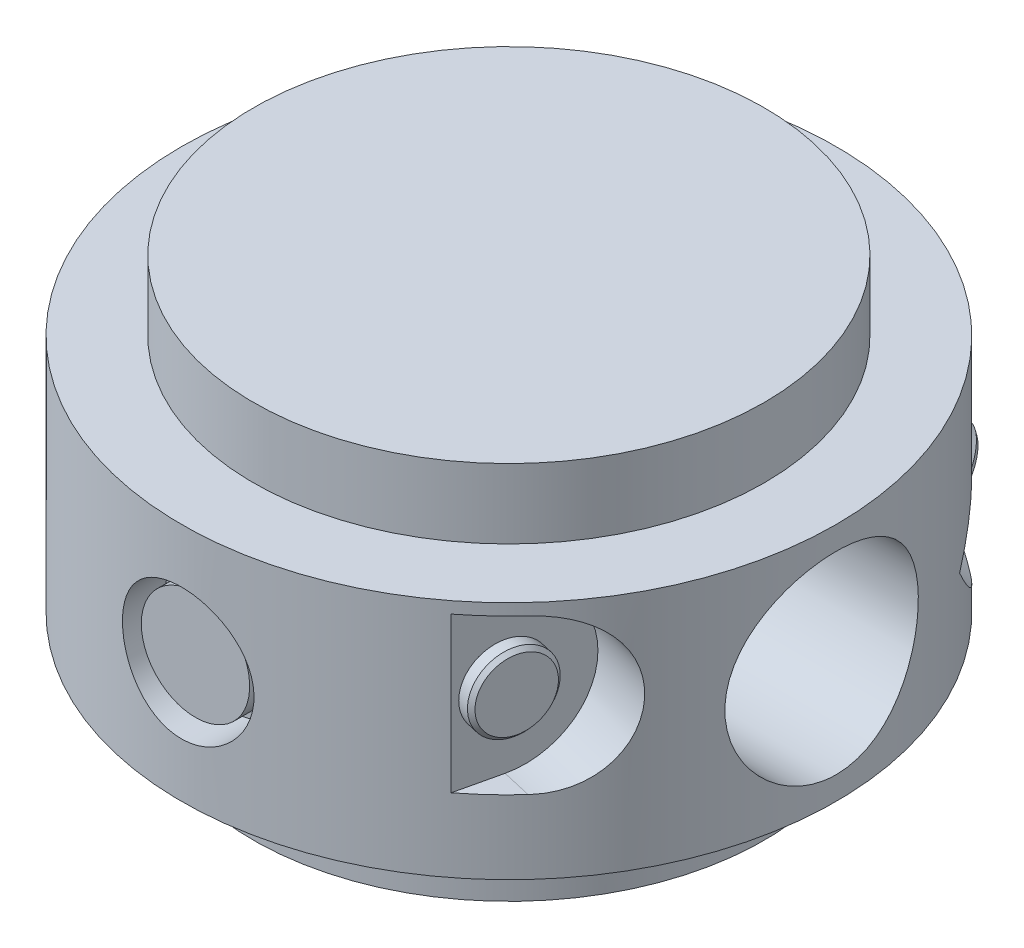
ISO-10303-21;
HEADER;
FILE_DESCRIPTION(('STEP AP214'),'2;1');
FILE_NAME('part.step','',(''),(''),'','','');
FILE_SCHEMA(('AUTOMOTIVE_DESIGN { 1 0 10303 214 1 1 1 1 }'));
ENDSEC;
DATA;
#1=APPLICATION_CONTEXT('core data for automotive mechanical design processes');
#2=APPLICATION_PROTOCOL_DEFINITION('international standard','automotive_design',2000,#1);
#3=PRODUCT_CONTEXT('',#1,'mechanical');
#4=PRODUCT('Part','Part','',(#3));
#5=PRODUCT_RELATED_PRODUCT_CATEGORY('part','',(#4));
#6=PRODUCT_DEFINITION_FORMATION('','',#4);
#7=PRODUCT_DEFINITION_CONTEXT('part definition',#1,'design');
#8=PRODUCT_DEFINITION('design','',#6,#7);
#9=PRODUCT_DEFINITION_SHAPE('','',#8);
#10=(LENGTH_UNIT() NAMED_UNIT(*) SI_UNIT(.MILLI.,.METRE.));
#11=(NAMED_UNIT(*) PLANE_ANGLE_UNIT() SI_UNIT($,.RADIAN.));
#12=(NAMED_UNIT(*) SI_UNIT($,.STERADIAN.) SOLID_ANGLE_UNIT());
#13=UNCERTAINTY_MEASURE_WITH_UNIT(LENGTH_MEASURE(1.E-05),#10,'distance_accuracy_value','');
#14=(GEOMETRIC_REPRESENTATION_CONTEXT(3) GLOBAL_UNCERTAINTY_ASSIGNED_CONTEXT((#13)) GLOBAL_UNIT_ASSIGNED_CONTEXT((#10,
#11,#12)) REPRESENTATION_CONTEXT('',''));
#15=CARTESIAN_POINT('',(0.,0.,0.));
#16=DIRECTION('',(0.,0.,1.));
#17=DIRECTION('',(1.,0.,0.));
#18=AXIS2_PLACEMENT_3D('',#15,#16,#17);
#19=CARTESIAN_POINT('',(777.944168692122,11.2387579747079,1146.33684981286));
#20=DIRECTION('',(0.498470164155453,-0.529919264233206,-0.68608532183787));
#21=DIRECTION('',(0.,0.791417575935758,-0.611275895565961));
#22=AXIS2_PLACEMENT_3D('',#19,#20,#21);
#23=PLANE('',#22);
#24=CARTESIAN_POINT('',(777.944168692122,11.2387579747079,1146.33684981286));
#25=DIRECTION('',(0.498470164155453,-0.529919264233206,-0.68608532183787));
#26=DIRECTION('',(0.,0.791417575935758,-0.611275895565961));
#27=AXIS2_PLACEMENT_3D('',#24,#25,#26);
#28=CIRCLE('',#27,25.);
#29=CARTESIAN_POINT('',(785.930515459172,-4.34728427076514,1164.17763321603));
#30=VERTEX_POINT('',#29);
#31=CARTESIAN_POINT('',(759.019613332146,-5.05560354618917,1145.1728107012));
#32=VERTEX_POINT('',#31);
#33=EDGE_CURVE('E34',#30,#32,#28,.T.);
#34=ORIENTED_EDGE('',*,*,#33,.T.);
#35=CARTESIAN_POINT('',(750.,-67.0461525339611,1186.5));
#36=DIRECTION('',(0.498470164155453,-0.529919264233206,-0.68608532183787));
#37=DIRECTION('',(-0.311478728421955,-0.848048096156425,0.428713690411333));
#38=AXIS2_PLACEMENT_3D('',#35,#36,#37);
#39=ELLIPSE('',#38,79.8234803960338,42.3);
#40=EDGE_CURVE('E60',#30,#32,#39,.F.);
#41=ORIENTED_EDGE('',*,*,#40,.F.);
#42=EDGE_LOOP('',(#34,#41));
#43=FACE_BOUND('',#42,.T.);
#44=CARTESIAN_POINT('',(772.337551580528,-4.02610775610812,1154.05369624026));
#45=DIRECTION('',(0.498470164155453,-0.529919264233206,-0.68608532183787));
#46=DIRECTION('',(0.,0.791417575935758,-0.611275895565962));
#47=AXIS2_PLACEMENT_3D('',#44,#45,#46);
#48=CIRCLE('',#47,5.);
#49=CARTESIAN_POINT('',(772.337551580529,-7.98319563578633,1157.11007571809));
#50=VERTEX_POINT('',#49);
#51=EDGE_CURVE('E70',#50,#50,#48,.T.);
#52=ORIENTED_EDGE('',*,*,#51,.F.);
#53=EDGE_LOOP('',(#52));
#54=FACE_BOUND('',#53,.T.);
#55=ADVANCED_FACE('F15',(#43,#54),#23,.T.);
#56=CARTESIAN_POINT('',(777.25786108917,3.94518444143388,1214.24272893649));
#57=DIRECTION('',(0.974370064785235,0.,0.224951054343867));
#58=DIRECTION('',(-0.224951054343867,0.,0.974370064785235));
#59=AXIS2_PLACEMENT_3D('',#56,#57,#58);
#60=PLANE('',#59);
#61=DIRECTION('',(0.224951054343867,0.,-0.974370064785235));
#62=VECTOR('',#61,1.);
#63=CARTESIAN_POINT('',(770.981720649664,-6.05481555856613,1241.42767983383));
#64=LINE('',#63,#62);
#65=CARTESIAN_POINT('',(775.950786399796,-6.05481555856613,1219.9042914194));
#66=VERTEX_POINT('',#65);
#67=CARTESIAN_POINT('',(777.25786108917,-6.05481555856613,1214.24272893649));
#68=VERTEX_POINT('',#67);
#69=EDGE_CURVE('E337',#66,#68,#64,.T.);
#70=ORIENTED_EDGE('',*,*,#69,.T.);
#71=CARTESIAN_POINT('',(777.25786108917,3.94518444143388,1214.24272893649));
#72=DIRECTION('',(0.974370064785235,0.,0.224951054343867));
#73=DIRECTION('',(-0.224951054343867,0.,0.974370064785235));
#74=AXIS2_PLACEMENT_3D('',#71,#72,#73);
#75=CIRCLE('',#74,10.);
#76=CARTESIAN_POINT('',(777.25786108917,13.9451844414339,1214.24272893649));
#77=VERTEX_POINT('',#76);
#78=EDGE_CURVE('E334',#68,#77,#75,.T.);
#79=ORIENTED_EDGE('',*,*,#78,.T.);
#80=DIRECTION('',(-0.224951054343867,0.,0.974370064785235));
#81=VECTOR('',#80,1.);
#82=CARTESIAN_POINT('',(777.25786108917,13.9451844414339,1214.24272893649));
#83=LINE('',#82,#81);
#84=CARTESIAN_POINT('',(775.950786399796,13.9451844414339,1219.9042914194));
#85=VERTEX_POINT('',#84);
#86=EDGE_CURVE('E42',#77,#85,#83,.T.);
#87=ORIENTED_EDGE('',*,*,#86,.T.);
#88=DIRECTION('',(0.,-1.,0.));
#89=VECTOR('',#88,1.);
#90=CARTESIAN_POINT('',(775.950786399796,135.087651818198,1219.9042914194));
#91=LINE('',#90,#89);
#92=EDGE_CURVE('E382',#66,#85,#91,.F.);
#93=ORIENTED_EDGE('',*,*,#92,.F.);
#94=EDGE_LOOP('',(#70,#79,#87,#93));
#95=FACE_BOUND('',#94,.T.);
#96=CARTESIAN_POINT('',(777.25786108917,3.94518444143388,1214.24272893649));
#97=DIRECTION('',(0.974370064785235,0.,0.224951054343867));
#98=DIRECTION('',(-0.224951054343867,0.,0.974370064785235));
#99=AXIS2_PLACEMENT_3D('',#96,#97,#98);
#100=CIRCLE('',#99,5.);
#101=CARTESIAN_POINT('',(776.133105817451,3.94518444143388,1219.11457926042));
#102=VERTEX_POINT('',#101);
#103=EDGE_CURVE('E69',#102,#102,#100,.T.);
#104=ORIENTED_EDGE('',*,*,#103,.F.);
#105=EDGE_LOOP('',(#104));
#106=FACE_BOUND('',#105,.T.);
#107=ADVANCED_FACE('F105',(#95,#106),#60,.T.);
#108=CARTESIAN_POINT('',(750.,-0.0548155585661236,1222.5));
#109=DIRECTION('',(0.,0.,1.));
#110=DIRECTION('',(-1.,0.,0.));
#111=AXIS2_PLACEMENT_3D('',#108,#109,#110);
#112=PLANE('',#111);
#113=CARTESIAN_POINT('',(750.,-0.0548155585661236,1222.5));
#114=DIRECTION('',(0.,0.,1.));
#115=DIRECTION('',(-1.,0.,0.));
#116=AXIS2_PLACEMENT_3D('',#113,#114,#115);
#117=CIRCLE('',#116,7.5);
#118=CARTESIAN_POINT('',(742.5,-0.0548155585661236,1222.5));
#119=VERTEX_POINT('',#118);
#120=EDGE_CURVE('E379',#119,#119,#117,.F.);
#121=ORIENTED_EDGE('',*,*,#120,.T.);
#122=EDGE_LOOP('',(#121));
#123=FACE_BOUND('',#122,.T.);
#124=CARTESIAN_POINT('',(750.,-0.0548155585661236,1222.5));
#125=DIRECTION('',(0.,0.,1.));
#126=DIRECTION('',(-1.,0.,0.));
#127=AXIS2_PLACEMENT_3D('',#124,#125,#126);
#128=CIRCLE('',#127,8.5);
#129=CARTESIAN_POINT('',(741.5,-0.0548155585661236,1222.5));
#130=VERTEX_POINT('',#129);
#131=EDGE_CURVE('E348',#130,#130,#128,.T.);
#132=ORIENTED_EDGE('',*,*,#131,.T.);
#133=EDGE_LOOP('',(#132));
#134=FACE_BOUND('',#133,.T.);
#135=ADVANCED_FACE('F108',(#123,#134),#112,.T.);
#136=CARTESIAN_POINT('',(750.,15.4451844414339,1153.5));
#137=DIRECTION('',(0.,1.,0.));
#138=DIRECTION('',(1.,0.,0.));
#139=AXIS2_PLACEMENT_3D('',#136,#137,#138);
#140=PLANE('',#139);
#141=CARTESIAN_POINT('',(750.,15.4451844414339,1186.5));
#142=DIRECTION('',(0.,1.,0.));
#143=DIRECTION('',(1.,0.,0.));
#144=AXIS2_PLACEMENT_3D('',#141,#142,#143);
#145=CIRCLE('',#144,42.3);
#146=CARTESIAN_POINT('',(792.3,15.4451844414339,1186.5));
#147=VERTEX_POINT('',#146);
#148=EDGE_CURVE('E367',#147,#147,#145,.F.);
#149=ORIENTED_EDGE('',*,*,#148,.F.);
#150=EDGE_LOOP('',(#149));
#151=FACE_BOUND('',#150,.T.);
#152=CARTESIAN_POINT('',(750.,15.4451844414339,1186.5));
#153=DIRECTION('',(0.,1.,0.));
#154=DIRECTION('',(1.,0.,0.));
#155=AXIS2_PLACEMENT_3D('',#152,#153,#154);
#156=CIRCLE('',#155,33.);
#157=CARTESIAN_POINT('',(783.,15.4451844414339,1186.5));
#158=VERTEX_POINT('',#157);
#159=EDGE_CURVE('E358',#158,#158,#156,.T.);
#160=ORIENTED_EDGE('',*,*,#159,.F.);
#161=EDGE_LOOP('',(#160));
#162=FACE_BOUND('',#161,.T.);
#163=ADVANCED_FACE('F162',(#151,#162),#140,.T.);
#164=CARTESIAN_POINT('',(750.,-15.5548155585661,1186.5));
#165=DIRECTION('',(0.,-1.,0.));
#166=DIRECTION('',(-1.,0.,0.));
#167=AXIS2_PLACEMENT_3D('',#164,#165,#166);
#168=PLANE('',#167);
#169=CARTESIAN_POINT('',(750.,-15.5548155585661,1186.5));
#170=DIRECTION('',(0.,-1.,0.));
#171=DIRECTION('',(-1.,0.,0.));
#172=AXIS2_PLACEMENT_3D('',#169,#170,#171);
#173=CIRCLE('',#172,42.3);
#174=CARTESIAN_POINT('',(707.7,-15.5548155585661,1186.5));
#175=VERTEX_POINT('',#174);
#176=EDGE_CURVE('E364',#175,#175,#173,.T.);
#177=ORIENTED_EDGE('',*,*,#176,.T.);
#178=EDGE_LOOP('',(#177));
#179=FACE_BOUND('',#178,.T.);
#180=CARTESIAN_POINT('',(750.,-15.5548155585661,1186.5));
#181=DIRECTION('',(0.,1.,0.));
#182=DIRECTION('',(1.,0.,0.));
#183=AXIS2_PLACEMENT_3D('',#180,#181,#182);
#184=CIRCLE('',#183,33.);
#185=CARTESIAN_POINT('',(783.,-15.5548155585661,1186.5));
#186=VERTEX_POINT('',#185);
#187=EDGE_CURVE('E361',#186,#186,#184,.T.);
#188=ORIENTED_EDGE('',*,*,#187,.T.);
#189=EDGE_LOOP('',(#188));
#190=FACE_BOUND('',#189,.T.);
#191=ADVANCED_FACE('F170',(#179,#190),#168,.T.);
#192=CARTESIAN_POINT('',(750.,135.087651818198,1186.5));
#193=DIRECTION('',(0.,-1.,0.));
#194=DIRECTION('',(-1.,0.,0.));
#195=AXIS2_PLACEMENT_3D('',#192,#193,#194);
#196=CYLINDRICAL_SURFACE('',#195,42.3);
#197=CARTESIAN_POINT('',(707.7,-12.5548155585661,1186.5));
#198=CARTESIAN_POINT('',(707.700000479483,-12.5548148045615,1186.84311989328));
#199=CARTESIAN_POINT('',(707.70418485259,-12.540676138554,1187.18625323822));
#200=CARTESIAN_POINT('',(707.720808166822,-12.4842475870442,1187.87000409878));
#201=CARTESIAN_POINT('',(707.733247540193,-12.4419562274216,1188.21062148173));
#202=CARTESIAN_POINT('',(707.766042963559,-12.3295869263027,1188.88695032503));
#203=CARTESIAN_POINT('',(707.786401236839,-12.2595011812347,1189.22266038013));
#204=CARTESIAN_POINT('',(707.834478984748,-12.0921565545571,1189.88668863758));
#205=CARTESIAN_POINT('',(707.862198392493,-11.9948979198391,1190.21500690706));
#206=CARTESIAN_POINT('',(707.924206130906,-11.7741850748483,1190.86152310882));
#207=CARTESIAN_POINT('',(707.958484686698,-11.6507698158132,1191.17973528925));
#208=CARTESIAN_POINT('',(708.032730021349,-11.3786345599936,1191.80445189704));
#209=CARTESIAN_POINT('',(708.072696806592,-11.2299145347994,1192.11095631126));
#210=CARTESIAN_POINT('',(708.157272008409,-10.9082917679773,1192.71029046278));
#211=CARTESIAN_POINT('',(708.20188001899,-10.735391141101,1193.00312139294));
#212=CARTESIAN_POINT('',(708.294606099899,-10.3665440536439,1193.57344553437));
#213=CARTESIAN_POINT('',(708.342725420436,-10.17058936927,1193.85093322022));
#214=CARTESIAN_POINT('',(708.442459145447,-9.75180360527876,1194.39552667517));
#215=CARTESIAN_POINT('',(708.494130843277,-9.52842323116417,1194.66219967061));
#216=CARTESIAN_POINT('',(708.598462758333,-9.06033220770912,1195.17591080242));
#217=CARTESIAN_POINT('',(708.651122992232,-8.81562119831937,1195.42294860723));
#218=CARTESIAN_POINT('',(708.756023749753,-8.30634101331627,1195.89591027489));
#219=CARTESIAN_POINT('',(708.808264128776,-8.04176529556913,1196.1218271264));
#220=CARTESIAN_POINT('',(708.910855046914,-7.49457477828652,1196.55091164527));
#221=CARTESIAN_POINT('',(708.961206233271,-7.21196624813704,1196.75408715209));
#222=CARTESIAN_POINT('',(709.05969762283,-6.62399879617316,1197.14059673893));
#223=CARTESIAN_POINT('',(709.107765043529,-6.31827668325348,1197.32339746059));
#224=CARTESIAN_POINT('',(709.199029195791,-5.69176902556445,1197.66251012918));
#225=CARTESIAN_POINT('',(709.242225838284,-5.37098320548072,1197.81882159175));
#226=CARTESIAN_POINT('',(709.322402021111,-4.71661542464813,1198.10366004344));
#227=CARTESIAN_POINT('',(709.359382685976,-4.38303579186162,1198.23219205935));
#228=CARTESIAN_POINT('',(709.425952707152,-3.70542651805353,1198.46038595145));
#229=CARTESIAN_POINT('',(709.45554231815,-3.36139723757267,1198.56004882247));
#230=CARTESIAN_POINT('',(709.505665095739,-2.67495247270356,1198.72727506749));
#231=CARTESIAN_POINT('',(709.526423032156,-2.33274836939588,1198.79563898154));
#232=CARTESIAN_POINT('',(709.559362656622,-1.64341576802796,1198.90354971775));
#233=CARTESIAN_POINT('',(709.571544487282,-1.29628735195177,1198.94309701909));
#234=CARTESIAN_POINT('',(709.586934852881,-0.599810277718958,1198.99299203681));
#235=CARTESIAN_POINT('',(709.590145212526,-0.250462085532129,1199.00334569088));
#236=CARTESIAN_POINT('',(709.587492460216,0.447836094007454,1198.99476919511));
#237=CARTESIAN_POINT('',(709.581629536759,0.796786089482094,1198.97583965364));
#238=CARTESIAN_POINT('',(709.561384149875,1.47945389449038,1198.91005529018));
#239=CARTESIAN_POINT('',(709.54730675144,1.81327767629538,1198.8642000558));
#240=CARTESIAN_POINT('',(709.511307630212,2.47571665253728,1198.74579982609));
#241=CARTESIAN_POINT('',(709.489386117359,2.80433198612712,1198.67325554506));
#242=CARTESIAN_POINT('',(709.438345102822,3.4541421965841,1198.50208798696));
#243=CARTESIAN_POINT('',(709.409225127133,3.77533658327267,1198.40346299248));
#244=CARTESIAN_POINT('',(709.344628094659,4.40818407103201,1198.18093086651));
#245=CARTESIAN_POINT('',(709.309150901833,4.71983696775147,1198.05702319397));
#246=CARTESIAN_POINT('',(709.232332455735,5.3356659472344,1197.78307465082));
#247=CARTESIAN_POINT('',(709.190920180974,5.63968967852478,1197.63271135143));
#248=CARTESIAN_POINT('',(709.103733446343,6.23415223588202,1197.30803553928));
#249=CARTESIAN_POINT('',(709.05795737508,6.52458598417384,1197.13371416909));
#250=CARTESIAN_POINT('',(708.963309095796,7.0899495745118,1196.76239190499));
#251=CARTESIAN_POINT('',(708.914437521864,7.36488257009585,1196.56539564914));
#252=CARTESIAN_POINT('',(708.814861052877,7.89780926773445,1196.14986967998));
#253=CARTESIAN_POINT('',(708.764155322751,8.15579509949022,1195.93133007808));
#254=CARTESIAN_POINT('',(708.660181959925,8.66325274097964,1195.46486559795));
#255=CARTESIAN_POINT('',(708.606893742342,8.91195653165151,1195.21610905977));
#256=CARTESIAN_POINT('',(708.501279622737,9.38751126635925,1194.69853185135));
#257=CARTESIAN_POINT('',(708.448953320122,9.6143714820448,1194.42971978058));
#258=CARTESIAN_POINT('',(708.346652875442,10.0449414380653,1193.87351032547));
#259=CARTESIAN_POINT('',(708.296679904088,10.2486397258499,1193.58610385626));
#260=CARTESIAN_POINT('',(708.200510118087,10.631233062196,1192.99479176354));
#261=CARTESIAN_POINT('',(708.154311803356,10.8101379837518,1192.69089277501));
#262=CARTESIAN_POINT('',(708.066662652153,11.1429850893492,1192.06644037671));
#263=CARTESIAN_POINT('',(708.025245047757,11.2967553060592,1191.74579055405));
#264=CARTESIAN_POINT('',(707.94868921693,11.5766447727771,1191.09190618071));
#265=CARTESIAN_POINT('',(707.913551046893,11.7027637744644,1190.75867151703));
#266=CARTESIAN_POINT('',(707.850575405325,11.9262316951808,1190.0820942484));
#267=CARTESIAN_POINT('',(707.822736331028,12.0235869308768,1189.73875388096));
#268=CARTESIAN_POINT('',(707.775164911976,12.1886707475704,1189.04447405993));
#269=CARTESIAN_POINT('',(707.755432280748,12.2564003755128,1188.69353487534));
#270=CARTESIAN_POINT('',(707.725194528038,12.3597535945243,1187.99912092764));
#271=CARTESIAN_POINT('',(707.714391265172,12.3964156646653,1187.65581339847));
#272=CARTESIAN_POINT('',(707.701178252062,12.4412151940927,1186.96718380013));
#273=CARTESIAN_POINT('',(707.698768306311,12.4493533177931,1186.62186177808));
#274=CARTESIAN_POINT('',(707.702409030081,12.4370311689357,1185.93181554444));
#275=CARTESIAN_POINT('',(707.708458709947,12.4165742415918,1185.58709126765));
#276=CARTESIAN_POINT('',(707.728847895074,12.34725668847,1184.90076108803));
#277=CARTESIAN_POINT('',(707.743187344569,12.298396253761,1184.55915516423));
#278=CARTESIAN_POINT('',(707.779357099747,12.1740901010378,1183.88897083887));
#279=CARTESIAN_POINT('',(707.801016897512,12.0992485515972,1183.56027087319));
#280=CARTESIAN_POINT('',(707.851315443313,11.9234438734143,1182.91049023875));
#281=CARTESIAN_POINT('',(707.879954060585,11.822481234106,1182.58940942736));
#282=CARTESIAN_POINT('',(707.943464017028,11.5952535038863,1181.95700814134));
#283=CARTESIAN_POINT('',(707.978334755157,11.4689908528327,1181.6456867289));
#284=CARTESIAN_POINT('',(708.053432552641,11.1920631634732,1181.03462826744));
#285=CARTESIAN_POINT('',(708.093661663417,11.0413887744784,1180.73489571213));
#286=CARTESIAN_POINT('',(708.179394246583,10.7131329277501,1180.14244463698));
#287=CARTESIAN_POINT('',(708.224995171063,10.5350273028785,1179.85003064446));
#288=CARTESIAN_POINT('',(708.319552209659,10.1556437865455,1179.28103182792));
#289=CARTESIAN_POINT('',(708.368509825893,9.954355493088,1179.00445419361));
#290=CARTESIAN_POINT('',(708.468500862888,9.52996120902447,1178.46888457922));
#291=CARTESIAN_POINT('',(708.519534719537,9.30685062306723,1178.20989632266));
#292=CARTESIAN_POINT('',(708.622319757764,8.84036025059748,1177.71123601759));
#293=CARTESIAN_POINT('',(708.674070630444,8.59698897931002,1177.47155593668));
#294=CARTESIAN_POINT('',(708.778792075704,8.08236295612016,1177.00467027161));
#295=CARTESIAN_POINT('',(708.831740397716,7.81042362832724,1176.77821355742));
#296=CARTESIAN_POINT('',(708.935450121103,7.24816714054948,1176.34906531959));
#297=CARTESIAN_POINT('',(708.986212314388,6.95785673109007,1176.1463651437));
#298=CARTESIAN_POINT('',(709.084103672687,6.36058432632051,1175.76603476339));
#299=CARTESIAN_POINT('',(709.131232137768,6.05361914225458,1175.58840938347));
#300=CARTESIAN_POINT('',(709.220434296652,5.42512210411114,1175.25962397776));
#301=CARTESIAN_POINT('',(709.262508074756,5.1035904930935,1175.10846351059));
#302=CARTESIAN_POINT('',(709.340111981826,4.44977297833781,1174.83450852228));
#303=CARTESIAN_POINT('',(709.375673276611,4.1175477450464,1174.71157814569));
#304=CARTESIAN_POINT('',(709.439384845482,3.44320494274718,1174.49419540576));
#305=CARTESIAN_POINT('',(709.467535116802,3.10108737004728,1174.39974305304));
#306=CARTESIAN_POINT('',(709.51550435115,2.40959234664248,1174.24020550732));
#307=CARTESIAN_POINT('',(709.535325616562,2.06021693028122,1174.17511219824));
#308=CARTESIAN_POINT('',(709.565988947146,1.35680834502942,1174.07488386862));
#309=CARTESIAN_POINT('',(709.576831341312,1.00277534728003,1174.03974775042));
#310=CARTESIAN_POINT('',(709.588923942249,0.307214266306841,1174.00058712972));
#311=CARTESIAN_POINT('',(709.590544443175,-0.0342403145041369,1173.99536155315));
#312=CARTESIAN_POINT('',(709.585134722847,-0.716357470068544,1174.01285656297));
#313=CARTESIAN_POINT('',(709.578104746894,-1.05702006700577,1174.03557635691));
#314=CARTESIAN_POINT('',(709.555613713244,-1.73505211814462,1174.10875004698));
#315=CARTESIAN_POINT('',(709.540153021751,-2.07242171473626,1174.15920273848));
#316=CARTESIAN_POINT('',(709.501276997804,-2.74146845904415,1174.28738717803));
#317=CARTESIAN_POINT('',(709.477861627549,-3.07314557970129,1174.3651190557));
#318=CARTESIAN_POINT('',(709.424101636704,-3.72465244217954,1174.54611926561));
#319=CARTESIAN_POINT('',(709.393841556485,-4.04457553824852,1174.6490772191));
#320=CARTESIAN_POINT('',(709.327114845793,-4.67452293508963,1174.88015219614));
#321=CARTESIAN_POINT('',(709.290648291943,-4.98454735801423,1175.00826890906));
#322=CARTESIAN_POINT('',(709.212528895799,-5.59275439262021,1175.28869447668));
#323=CARTESIAN_POINT('',(709.170876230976,-5.89093740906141,1175.44100250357));
#324=CARTESIAN_POINT('',(709.083497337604,-6.47379226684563,1175.76880338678));
#325=CARTESIAN_POINT('',(709.037769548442,-6.75845886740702,1175.94430513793));
#326=CARTESIAN_POINT('',(708.941805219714,-7.32222258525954,1176.32383798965));
#327=CARTESIAN_POINT('',(708.891466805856,-7.60077440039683,1176.5286536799));
#328=CARTESIAN_POINT('',(708.789096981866,-8.13990205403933,1176.96056925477));
#329=CARTESIAN_POINT('',(708.737064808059,-8.40046961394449,1177.18767928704));
#330=CARTESIAN_POINT('',(708.632723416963,-8.90194772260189,1177.66271735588));
#331=CARTESIAN_POINT('',(708.580414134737,-9.14285342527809,1177.91065049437));
#332=CARTESIAN_POINT('',(708.476952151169,-9.60331404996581,1178.42563105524));
#333=CARTESIAN_POINT('',(708.425798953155,-9.82287827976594,1178.69267005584));
#334=CARTESIAN_POINT('',(708.324557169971,-10.2452908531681,1179.25220267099));
#335=CARTESIAN_POINT('',(708.274540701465,-10.4474827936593,1179.54520541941));
#336=CARTESIAN_POINT('',(708.178569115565,-10.8263364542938,1180.14776107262));
#337=CARTESIAN_POINT('',(708.132612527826,-11.0030074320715,1180.45730792));
#338=CARTESIAN_POINT('',(708.046052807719,-11.3294980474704,1181.09088632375));
#339=CARTESIAN_POINT('',(708.005448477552,-11.4793236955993,1181.41491461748));
#340=CARTESIAN_POINT('',(707.930750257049,-11.7509190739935,1182.07523171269));
#341=CARTESIAN_POINT('',(707.896655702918,-11.8726916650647,1182.41151925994));
#342=CARTESIAN_POINT('',(707.839460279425,-12.0747727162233,1183.05459765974));
#343=CARTESIAN_POINT('',(707.815545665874,-12.1582406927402,1183.36032758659));
#344=CARTESIAN_POINT('',(707.774138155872,-12.3017800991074,1183.97764780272));
#345=CARTESIAN_POINT('',(707.756644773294,-12.3618533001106,1184.28923764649));
#346=CARTESIAN_POINT('',(707.728490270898,-12.4581480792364,1184.91634520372));
#347=CARTESIAN_POINT('',(707.71782821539,-12.4943729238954,1185.2318623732));
#348=CARTESIAN_POINT('',(707.703582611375,-12.542707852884,1185.8649157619));
#349=CARTESIAN_POINT('',(707.699999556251,-12.5548162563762,1186.18245212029));
#350=CARTESIAN_POINT('',(707.7,-12.5548155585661,1186.5));
#351=B_SPLINE_CURVE_WITH_KNOTS('',3,(#197,#198,#199,#200,#201,#202,#203,#204,#205,#206,#207,
#208,#209,#210,#211,#212,#213,#214,#215,#216,#217,#218,#219,#220,#221,#222,#223,#224,#225,#226,
#227,#228,#229,#230,#231,#232,#233,#234,#235,#236,#237,#238,#239,#240,#241,#242,#243,#244,#245,
#246,#247,#248,#249,#250,#251,#252,#253,#254,#255,#256,#257,#258,#259,#260,#261,#262,#263,#264,
#265,#266,#267,#268,#269,#270,#271,#272,#273,#274,#275,#276,#277,#278,#279,#280,#281,#282,#283,
#284,#285,#286,#287,#288,#289,#290,#291,#292,#293,#294,#295,#296,#297,#298,#299,#300,#301,#302,
#303,#304,#305,#306,#307,#308,#309,#310,#311,#312,#313,#314,#315,#316,#317,#318,#319,#320,#321,
#322,#323,#324,#325,#326,#327,#328,#329,#330,#331,#332,#333,#334,#335,#336,#337,#338,#339,#340,
#341,#342,#343,#344,#345,#346,#347,#348,#349,#350),.UNSPECIFIED.,.T.,.F.,(4,2,2,2,2,2,2,2,2,2,2,
2,2,2,2,2,2,2,2,2,2,2,2,2,2,2,2,2,2,2,2,2,2,2,2,2,2,2,2,2,2,2,2,2,2,2,2,2,2,2,2,2,2,2,2,2,2,2,2,
2,2,2,2,2,2,2,2,2,2,2,2,2,2,2,2,2,4),(0.,1.02906757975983,2.05818904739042,3.08759965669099,
4.11700091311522,5.14487987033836,6.17275998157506,7.20055025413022,8.22870827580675,
9.28256159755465,10.3364327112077,11.3906524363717,12.4445076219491,13.521493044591,
14.5984981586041,15.6753082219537,16.7520811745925,17.7995187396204,18.8469388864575,
19.8941459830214,20.9413313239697,21.9519004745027,22.9624425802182,23.9730512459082,
24.9836815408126,26.0076106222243,27.0319192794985,28.0560187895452,29.0805905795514,
30.146658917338,31.2122727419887,32.2784111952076,33.3441238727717,34.4168476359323,
35.4895810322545,36.5620786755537,37.6345384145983,38.6695507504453,39.7045389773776,
40.7394061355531,41.7742663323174,42.7865165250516,43.7987477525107,44.8108814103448,
45.8234036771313,46.858458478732,47.8939795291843,48.9297191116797,49.9650255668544,
51.037224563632,52.1090318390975,53.1810450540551,54.2530403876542,55.3197633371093,
56.3864866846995,57.4529149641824,58.5193041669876,59.542554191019,60.5657751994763,
61.5889517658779,62.6121331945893,63.6233074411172,64.6344692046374,65.645596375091,
66.6571124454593,67.7040971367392,68.7515606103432,69.7992814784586,70.8465433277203,
71.9237115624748,73.0004880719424,74.0770231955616,75.1534484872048,76.1059580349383,
77.0583954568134,78.0107023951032,78.9630757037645),.UNSPECIFIED.);
#352=CARTESIAN_POINT('',(707.7,-12.5548155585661,1186.5));
#353=VERTEX_POINT('',#352);
#354=EDGE_CURVE('E10',#353,#353,#351,.T.);
#355=ORIENTED_EDGE('',*,*,#354,.F.);
#356=EDGE_LOOP('',(#355));
#357=FACE_BOUND('',#356,.T.);
#358=CARTESIAN_POINT('',(792.3,-12.5548155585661,1186.5));
#359=CARTESIAN_POINT('',(792.299999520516,-12.5548148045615,1186.15688010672));
#360=CARTESIAN_POINT('',(792.29581514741,-12.540676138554,1185.81374676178));
#361=CARTESIAN_POINT('',(792.279191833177,-12.4842475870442,1185.12999590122));
#362=CARTESIAN_POINT('',(792.266752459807,-12.4419562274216,1184.78937851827));
#363=CARTESIAN_POINT('',(792.233957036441,-12.3295869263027,1184.11304967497));
#364=CARTESIAN_POINT('',(792.213598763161,-12.2595011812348,1183.77733961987));
#365=CARTESIAN_POINT('',(792.165521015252,-12.0921565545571,1183.11331136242));
#366=CARTESIAN_POINT('',(792.137801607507,-11.9948979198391,1182.78499309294));
#367=CARTESIAN_POINT('',(792.075793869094,-11.7741850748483,1182.13847689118));
#368=CARTESIAN_POINT('',(792.041515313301,-11.6507698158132,1181.82026471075));
#369=CARTESIAN_POINT('',(791.967269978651,-11.3786345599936,1181.19554810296));
#370=CARTESIAN_POINT('',(791.927303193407,-11.2299145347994,1180.88904368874));
#371=CARTESIAN_POINT('',(791.84272799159,-10.9082917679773,1180.28970953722));
#372=CARTESIAN_POINT('',(791.79811998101,-10.735391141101,1179.99687860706));
#373=CARTESIAN_POINT('',(791.7053939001,-10.3665440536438,1179.42655446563));
#374=CARTESIAN_POINT('',(791.657274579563,-10.17058936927,1179.14906677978));
#375=CARTESIAN_POINT('',(791.557540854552,-9.7518036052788,1178.60447332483));
#376=CARTESIAN_POINT('',(791.505869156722,-9.52842323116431,1178.33780032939));
#377=CARTESIAN_POINT('',(791.401537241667,-9.06033220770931,1177.82408919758));
#378=CARTESIAN_POINT('',(791.348877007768,-8.81562119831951,1177.57705139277));
#379=CARTESIAN_POINT('',(791.243976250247,-8.30634101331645,1177.10408972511));
#380=CARTESIAN_POINT('',(791.191735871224,-8.04176529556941,1176.87817287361));
#381=CARTESIAN_POINT('',(791.089144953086,-7.49457477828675,1176.44908835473));
#382=CARTESIAN_POINT('',(791.038793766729,-7.21196624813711,1176.24591284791));
#383=CARTESIAN_POINT('',(790.94030237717,-6.62399879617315,1175.85940326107));
#384=CARTESIAN_POINT('',(790.892234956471,-6.31827668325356,1175.67660253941));
#385=CARTESIAN_POINT('',(790.800970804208,-5.69176902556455,1175.33748987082));
#386=CARTESIAN_POINT('',(790.757774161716,-5.37098320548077,1175.18117840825));
#387=CARTESIAN_POINT('',(790.677597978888,-4.71661542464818,1174.89633995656));
#388=CARTESIAN_POINT('',(790.640617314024,-4.38303579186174,1174.76780794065));
#389=CARTESIAN_POINT('',(790.574047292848,-3.70542651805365,1174.53961404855));
#390=CARTESIAN_POINT('',(790.54445768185,-3.36139723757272,1174.43995117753));
#391=CARTESIAN_POINT('',(790.494334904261,-2.67495247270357,1174.27272493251));
#392=CARTESIAN_POINT('',(790.473576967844,-2.33274836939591,1174.20436101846));
#393=CARTESIAN_POINT('',(790.440637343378,-1.64341576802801,1174.09645028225));
#394=CARTESIAN_POINT('',(790.428455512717,-1.29628735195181,1174.05690298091));
#395=CARTESIAN_POINT('',(790.413065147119,-0.599810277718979,1174.00700796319));
#396=CARTESIAN_POINT('',(790.409854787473,-0.250462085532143,1173.99665430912));
#397=CARTESIAN_POINT('',(790.412507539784,0.447836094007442,1174.00523080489));
#398=CARTESIAN_POINT('',(790.418370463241,0.796786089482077,1174.02416034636));
#399=CARTESIAN_POINT('',(790.438615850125,1.4794538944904,1174.08994470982));
#400=CARTESIAN_POINT('',(790.45269324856,1.81327767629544,1174.13579994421));
#401=CARTESIAN_POINT('',(790.488692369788,2.47571665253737,1174.25420017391));
#402=CARTESIAN_POINT('',(790.51061388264,2.80433198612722,1174.32674445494));
#403=CARTESIAN_POINT('',(790.561654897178,3.45414219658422,1174.49791201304));
#404=CARTESIAN_POINT('',(790.590774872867,3.77533658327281,1174.59653700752));
#405=CARTESIAN_POINT('',(790.655371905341,4.40818407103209,1174.81906913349));
#406=CARTESIAN_POINT('',(790.690849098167,4.71983696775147,1174.94297680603));
#407=CARTESIAN_POINT('',(790.767667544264,5.33566594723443,1175.21692534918));
#408=CARTESIAN_POINT('',(790.809079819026,5.63968967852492,1175.36728864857));
#409=CARTESIAN_POINT('',(790.896266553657,6.23415223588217,1175.69196446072));
#410=CARTESIAN_POINT('',(790.942042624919,6.52458598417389,1175.86628583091));
#411=CARTESIAN_POINT('',(791.036690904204,7.0899495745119,1176.23760809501));
#412=CARTESIAN_POINT('',(791.085562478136,7.36488257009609,1176.43460435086));
#413=CARTESIAN_POINT('',(791.185138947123,7.89780926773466,1176.85013032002));
#414=CARTESIAN_POINT('',(791.235844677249,8.15579509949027,1177.06866992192));
#415=CARTESIAN_POINT('',(791.339818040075,8.66325274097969,1177.53513440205));
#416=CARTESIAN_POINT('',(791.393106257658,8.91195653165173,1177.78389094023));
#417=CARTESIAN_POINT('',(791.498720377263,9.38751126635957,1178.30146814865));
#418=CARTESIAN_POINT('',(791.551046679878,9.61437148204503,1178.57028021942));
#419=CARTESIAN_POINT('',(791.653347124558,10.0449414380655,1179.12648967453));
#420=CARTESIAN_POINT('',(791.703320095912,10.2486397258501,1179.41389614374));
#421=CARTESIAN_POINT('',(791.799489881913,10.6312330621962,1180.00520823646));
#422=CARTESIAN_POINT('',(791.845688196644,10.8101379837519,1180.30910722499));
#423=CARTESIAN_POINT('',(791.933337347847,11.1429850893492,1180.93355962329));
#424=CARTESIAN_POINT('',(791.974754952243,11.2967553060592,1181.25420944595));
#425=CARTESIAN_POINT('',(792.051310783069,11.5766447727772,1181.90809381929));
#426=CARTESIAN_POINT('',(792.086448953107,11.7027637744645,1182.24132848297));
#427=CARTESIAN_POINT('',(792.149424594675,11.9262316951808,1182.9179057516));
#428=CARTESIAN_POINT('',(792.177263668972,12.0235869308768,1183.26124611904));
#429=CARTESIAN_POINT('',(792.224835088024,12.1886707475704,1183.95552594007));
#430=CARTESIAN_POINT('',(792.244567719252,12.2564003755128,1184.30646512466));
#431=CARTESIAN_POINT('',(792.274805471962,12.3597535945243,1185.00087907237));
#432=CARTESIAN_POINT('',(792.285608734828,12.3964156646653,1185.34418660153));
#433=CARTESIAN_POINT('',(792.298821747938,12.4412151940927,1186.03281619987));
#434=CARTESIAN_POINT('',(792.301231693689,12.4493533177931,1186.37813822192));
#435=CARTESIAN_POINT('',(792.297590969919,12.4370311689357,1187.06818445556));
#436=CARTESIAN_POINT('',(792.291541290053,12.4165742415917,1187.41290873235));
#437=CARTESIAN_POINT('',(792.271152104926,12.34725668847,1188.09923891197));
#438=CARTESIAN_POINT('',(792.256812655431,12.298396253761,1188.44084483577));
#439=CARTESIAN_POINT('',(792.220642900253,12.1740901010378,1189.11102916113));
#440=CARTESIAN_POINT('',(792.198983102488,12.0992485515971,1189.43972912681));
#441=CARTESIAN_POINT('',(792.148684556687,11.9234438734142,1190.08950976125));
#442=CARTESIAN_POINT('',(792.120045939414,11.8224812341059,1190.41059057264));
#443=CARTESIAN_POINT('',(792.056535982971,11.5952535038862,1191.04299185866));
#444=CARTESIAN_POINT('',(792.021665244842,11.4689908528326,1191.3543132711));
#445=CARTESIAN_POINT('',(791.94656744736,11.1920631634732,1191.96537173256));
#446=CARTESIAN_POINT('',(791.906338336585,11.0413887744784,1192.26510428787));
#447=CARTESIAN_POINT('',(791.820605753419,10.7131329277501,1192.85755536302));
#448=CARTESIAN_POINT('',(791.775004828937,10.5350273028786,1193.14996935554));
#449=CARTESIAN_POINT('',(791.68044779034,10.1556437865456,1193.71896817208));
#450=CARTESIAN_POINT('',(791.631490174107,9.95435549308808,1193.99554580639));
#451=CARTESIAN_POINT('',(791.531499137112,9.52996120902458,1194.53111542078));
#452=CARTESIAN_POINT('',(791.480465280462,9.30685062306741,1194.79010367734));
#453=CARTESIAN_POINT('',(791.377680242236,8.8403602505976,1195.28876398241));
#454=CARTESIAN_POINT('',(791.325929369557,8.59698897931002,1195.52844406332));
#455=CARTESIAN_POINT('',(791.221207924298,8.08236295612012,1195.99532972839));
#456=CARTESIAN_POINT('',(791.168259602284,7.81042362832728,1196.22178644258));
#457=CARTESIAN_POINT('',(791.064549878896,7.24816714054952,1196.65093468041));
#458=CARTESIAN_POINT('',(791.013787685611,6.95785673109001,1196.8536348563));
#459=CARTESIAN_POINT('',(790.915896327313,6.36058432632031,1197.23396523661));
#460=CARTESIAN_POINT('',(790.868767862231,6.05361914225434,1197.41159061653));
#461=CARTESIAN_POINT('',(790.779565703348,5.42512210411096,1197.74037602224));
#462=CARTESIAN_POINT('',(790.737491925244,5.10359049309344,1197.89153648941));
#463=CARTESIAN_POINT('',(790.659888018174,4.44977297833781,1198.16549147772));
#464=CARTESIAN_POINT('',(790.624326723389,4.11754774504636,1198.28842185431));
#465=CARTESIAN_POINT('',(790.560615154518,3.4432049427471,1198.50580459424));
#466=CARTESIAN_POINT('',(790.532464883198,3.1010873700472,1198.60025694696));
#467=CARTESIAN_POINT('',(790.48449564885,2.40959234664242,1198.75979449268));
#468=CARTESIAN_POINT('',(790.464674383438,2.06021693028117,1198.82488780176));
#469=CARTESIAN_POINT('',(790.434011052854,1.3568083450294,1198.92511613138));
#470=CARTESIAN_POINT('',(790.423168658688,1.00277534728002,1198.96025224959));
#471=CARTESIAN_POINT('',(790.411076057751,0.307214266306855,1198.99941287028));
#472=CARTESIAN_POINT('',(790.409455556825,-0.0342403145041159,1199.00463844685));
#473=CARTESIAN_POINT('',(790.414865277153,-0.716357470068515,1198.98714343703));
#474=CARTESIAN_POINT('',(790.421895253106,-1.05702006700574,1198.96442364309));
#475=CARTESIAN_POINT('',(790.444386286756,-1.73505211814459,1198.89124995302));
#476=CARTESIAN_POINT('',(790.459846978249,-2.07242171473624,1198.84079726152));
#477=CARTESIAN_POINT('',(790.498723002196,-2.74146845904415,1198.71261282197));
#478=CARTESIAN_POINT('',(790.522138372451,-3.0731455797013,1198.6348809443));
#479=CARTESIAN_POINT('',(790.575898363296,-3.72465244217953,1198.45388073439));
#480=CARTESIAN_POINT('',(790.606158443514,-4.04457553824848,1198.3509227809));
#481=CARTESIAN_POINT('',(790.672885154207,-4.67452293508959,1198.11984780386));
#482=CARTESIAN_POINT('',(790.709351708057,-4.98454735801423,1197.99173109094));
#483=CARTESIAN_POINT('',(790.787471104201,-5.59275439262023,1197.71130552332));
#484=CARTESIAN_POINT('',(790.829123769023,-5.89093740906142,1197.55899749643));
#485=CARTESIAN_POINT('',(790.916502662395,-6.47379226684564,1197.23119661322));
#486=CARTESIAN_POINT('',(790.962230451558,-6.75845886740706,1197.05569486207));
#487=CARTESIAN_POINT('',(791.058194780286,-7.32222258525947,1196.67616201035));
#488=CARTESIAN_POINT('',(791.108533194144,-7.60077440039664,1196.4713463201));
#489=CARTESIAN_POINT('',(791.210903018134,-8.13990205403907,1196.03943074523));
#490=CARTESIAN_POINT('',(791.262935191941,-8.40046961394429,1195.81232071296));
#491=CARTESIAN_POINT('',(791.367276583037,-8.90194772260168,1195.33728264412));
#492=CARTESIAN_POINT('',(791.419585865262,-9.14285342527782,1195.08934950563));
#493=CARTESIAN_POINT('',(791.523047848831,-9.60331404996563,1194.57436894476));
#494=CARTESIAN_POINT('',(791.574201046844,-9.82287827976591,1194.30732994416));
#495=CARTESIAN_POINT('',(791.675442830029,-10.2452908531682,1193.74779732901));
#496=CARTESIAN_POINT('',(791.725459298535,-10.4474827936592,1193.45479458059));
#497=CARTESIAN_POINT('',(791.821430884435,-10.8263364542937,1192.85223892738));
#498=CARTESIAN_POINT('',(791.867387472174,-11.0030074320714,1192.54269208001));
#499=CARTESIAN_POINT('',(791.953947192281,-11.3294980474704,1191.90911367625));
#500=CARTESIAN_POINT('',(791.994551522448,-11.4793236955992,1191.58508538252));
#501=CARTESIAN_POINT('',(792.069249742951,-11.7509190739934,1190.92476828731));
#502=CARTESIAN_POINT('',(792.103344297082,-11.8726916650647,1190.58848074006));
#503=CARTESIAN_POINT('',(792.160539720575,-12.0747727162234,1189.94540234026));
#504=CARTESIAN_POINT('',(792.184454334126,-12.1582406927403,1189.63967241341));
#505=CARTESIAN_POINT('',(792.225861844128,-12.3017800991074,1189.02235219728));
#506=CARTESIAN_POINT('',(792.243355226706,-12.3618533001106,1188.71076235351));
#507=CARTESIAN_POINT('',(792.271509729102,-12.4581480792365,1188.08365479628));
#508=CARTESIAN_POINT('',(792.28217178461,-12.4943729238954,1187.7681376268));
#509=CARTESIAN_POINT('',(792.296417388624,-12.542707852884,1187.1350842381));
#510=CARTESIAN_POINT('',(792.300000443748,-12.5548162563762,1186.81754787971));
#511=CARTESIAN_POINT('',(792.3,-12.5548155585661,1186.5));
#512=B_SPLINE_CURVE_WITH_KNOTS('',3,(#358,#359,#360,#361,#362,#363,#364,#365,#366,#367,#368,
#369,#370,#371,#372,#373,#374,#375,#376,#377,#378,#379,#380,#381,#382,#383,#384,#385,#386,#387,
#388,#389,#390,#391,#392,#393,#394,#395,#396,#397,#398,#399,#400,#401,#402,#403,#404,#405,#406,
#407,#408,#409,#410,#411,#412,#413,#414,#415,#416,#417,#418,#419,#420,#421,#422,#423,#424,#425,
#426,#427,#428,#429,#430,#431,#432,#433,#434,#435,#436,#437,#438,#439,#440,#441,#442,#443,#444,
#445,#446,#447,#448,#449,#450,#451,#452,#453,#454,#455,#456,#457,#458,#459,#460,#461,#462,#463,
#464,#465,#466,#467,#468,#469,#470,#471,#472,#473,#474,#475,#476,#477,#478,#479,#480,#481,#482,
#483,#484,#485,#486,#487,#488,#489,#490,#491,#492,#493,#494,#495,#496,#497,#498,#499,#500,#501,
#502,#503,#504,#505,#506,#507,#508,#509,#510,#511),.UNSPECIFIED.,.T.,.F.,(4,2,2,2,2,2,2,2,2,2,2,
2,2,2,2,2,2,2,2,2,2,2,2,2,2,2,2,2,2,2,2,2,2,2,2,2,2,2,2,2,2,2,2,2,2,2,2,2,2,2,2,2,2,2,2,2,2,2,2,
2,2,2,2,2,2,2,2,2,2,2,2,2,2,2,2,2,4),(0.,1.02906757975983,2.0581890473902,3.08759965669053,
4.11700091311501,5.14487987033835,6.17275998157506,7.20055025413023,8.22870827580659,
9.28256159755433,10.3364327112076,11.3906524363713,12.444507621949,13.5214930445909,
14.5984981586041,15.6753082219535,16.7520811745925,17.7995187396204,18.8469388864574,
19.8941459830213,20.9413313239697,21.9519004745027,22.9624425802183,23.9730512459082,
24.9836815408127,26.0076106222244,27.0319192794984,28.0560187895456,29.0805905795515,
30.1466589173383,31.2122727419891,32.2784111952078,33.3441238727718,34.4168476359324,
35.4895810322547,36.5620786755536,37.6345384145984,38.669550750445,39.7045389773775,
40.7394061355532,41.7742663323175,42.7865165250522,43.7987477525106,44.810881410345,
45.8234036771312,46.8584584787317,47.893979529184,48.9297191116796,49.9650255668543,
51.0372245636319,52.1090318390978,53.1810450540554,54.2530403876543,55.3197633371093,
56.3864866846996,57.4529149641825,58.5193041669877,59.542554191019,60.5657751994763,
61.5889517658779,62.6121331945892,63.6233074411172,64.6344692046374,65.645596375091,
66.6571124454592,67.7040971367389,68.7515606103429,69.7992814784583,70.8465433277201,
71.9237115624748,73.0004880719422,74.0770231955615,75.1534484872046,76.1059580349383,
77.0583954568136,78.0107023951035,78.9630757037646),.UNSPECIFIED.);
#513=CARTESIAN_POINT('',(792.3,-12.5548155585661,1186.5));
#514=VERTEX_POINT('',#513);
#515=EDGE_CURVE('E28',#514,#514,#512,.T.);
#516=ORIENTED_EDGE('',*,*,#515,.F.);
#517=EDGE_LOOP('',(#516));
#518=FACE_BOUND('',#517,.T.);
#519=CARTESIAN_POINT('',(785.930515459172,-4.34728427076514,1164.17763321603));
#520=CARTESIAN_POINT('',(785.810815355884,-4.62914484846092,1163.98496824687));
#521=CARTESIAN_POINT('',(785.687477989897,-4.90779212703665,1163.78989207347));
#522=CARTESIAN_POINT('',(785.433104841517,-5.45820830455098,1163.39501545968));
#523=CARTESIAN_POINT('',(785.30206789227,-5.72997615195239,1163.19521430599));
#524=CARTESIAN_POINT('',(784.896290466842,-6.53522178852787,1162.58815575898));
#525=CARTESIAN_POINT('',(784.609356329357,-7.05751635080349,1162.17401074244));
#526=CARTESIAN_POINT('',(783.995578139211,-8.07375539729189,1161.3232315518));
#527=CARTESIAN_POINT('',(783.668235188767,-8.56720545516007,1160.88636493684));
#528=CARTESIAN_POINT('',(782.973529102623,-9.51034310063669,1159.99803996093));
#529=CARTESIAN_POINT('',(782.606201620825,-9.96006901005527,1159.54659484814));
#530=CARTESIAN_POINT('',(781.941264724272,-10.6840895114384,1158.76506021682));
#531=CARTESIAN_POINT('',(781.654417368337,-10.9713846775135,1158.43783045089));
#532=CARTESIAN_POINT('',(781.05792388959,-11.5160299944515,1157.77905362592));
#533=CARTESIAN_POINT('',(780.748276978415,-11.7733791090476,1157.44750641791));
#534=CARTESIAN_POINT('',(780.10718267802,-12.2529269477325,1156.78368353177));
#535=CARTESIAN_POINT('',(779.775841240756,-12.4752807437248,1156.45141808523));
#536=CARTESIAN_POINT('',(779.090247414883,-12.8819785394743,1155.78721584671));
#537=CARTESIAN_POINT('',(778.735999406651,-13.0663297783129,1155.45527900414));
#538=CARTESIAN_POINT('',(778.062247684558,-13.3675398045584,1154.84603726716));
#539=CARTESIAN_POINT('',(777.74587880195,-13.4904321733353,1154.56824524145));
#540=CARTESIAN_POINT('',(777.098624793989,-13.7038734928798,1154.01715683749));
#541=CARTESIAN_POINT('',(776.767741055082,-13.7944255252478,1153.74386003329));
#542=CARTESIAN_POINT('',(776.093034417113,-13.9413854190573,1153.20389991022));
#543=CARTESIAN_POINT('',(775.749207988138,-13.9977838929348,1152.93723843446));
#544=CARTESIAN_POINT('',(775.05089025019,-14.0752106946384,1152.41285381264));
#545=CARTESIAN_POINT('',(774.696398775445,-14.0962384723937,1152.15513080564));
#546=CARTESIAN_POINT('',(773.978970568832,-14.10251903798,1151.65044442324));
#547=CARTESIAN_POINT('',(773.616025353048,-14.0877342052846,1151.4034926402));
#548=CARTESIAN_POINT('',(772.884872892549,-14.0227456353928,1150.92242114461));
#549=CARTESIAN_POINT('',(772.516665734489,-13.9725424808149,1150.68830122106));
#550=CARTESIAN_POINT('',(771.777878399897,-13.8379453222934,1150.23428650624));
#551=CARTESIAN_POINT('',(771.407298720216,-13.7535582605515,1150.01438883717));
#552=CARTESIAN_POINT('',(770.666317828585,-13.5524439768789,1149.58962496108));
#553=CARTESIAN_POINT('',(770.295916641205,-13.4357131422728,1149.38476043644));
#554=CARTESIAN_POINT('',(769.469659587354,-13.1407708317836,1148.9434989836));
#555=CARTESIAN_POINT('',(769.014463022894,-12.9545379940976,1148.7112136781));
#556=CARTESIAN_POINT('',(768.111521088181,-12.540729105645,1148.27022737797));
#557=CARTESIAN_POINT('',(767.663777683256,-12.313142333,1148.06153252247));
#558=CARTESIAN_POINT('',(766.776506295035,-11.8203921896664,1147.66604778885));
#559=CARTESIAN_POINT('',(766.33702431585,-11.5550644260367,1147.47936064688));
#560=CARTESIAN_POINT('',(765.470165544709,-10.9921644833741,1147.12763792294));
#561=CARTESIAN_POINT('',(765.042792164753,-10.6945833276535,1146.96260839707));
#562=CARTESIAN_POINT('',(764.10981846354,-10.0034487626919,1146.6189123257));
#563=CARTESIAN_POINT('',(763.607458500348,-9.60311044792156,1146.44510678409));
#564=CARTESIAN_POINT('',(762.623816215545,-8.7670564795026,1146.1243006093));
#565=CARTESIAN_POINT('',(762.142545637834,-8.33132149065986,1145.97731477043));
#566=CARTESIAN_POINT('',(761.208249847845,-7.43589051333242,1145.70909230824));
#567=CARTESIAN_POINT('',(760.754932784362,-6.97659333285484,1145.58753735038));
#568=CARTESIAN_POINT('',(760.091592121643,-6.26923099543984,1145.42078845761));
#569=CARTESIAN_POINT('',(759.873395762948,-6.0305450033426,1145.3678339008));
#570=CARTESIAN_POINT('',(759.442437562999,-5.54734995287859,1145.26676934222));
#571=CARTESIAN_POINT('',(759.229675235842,-5.30284141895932,1145.21865890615));
#572=CARTESIAN_POINT('',(759.019613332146,-5.05560354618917,1145.1728107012));
#573=B_SPLINE_CURVE_WITH_KNOTS('',3,(#519,#520,#521,#522,#523,#524,#525,#526,#527,#528,#529,
#530,#531,#532,#533,#534,#535,#536,#537,#538,#539,#540,#541,#542,#543,#544,#545,#546,#547,#548,
#549,#550,#551,#552,#553,#554,#555,#556,#557,#558,#559,#560,#561,#562,#563,#564,#565,#566,#567,
#568,#569,#570,#571,#572),.UNSPECIFIED.,.F.,.F.,(4,2,2,2,2,2,2,2,2,2,2,2,2,2,2,2,2,2,2,2,2,2,2,
2,2,2,4),(0.,1.0852936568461,2.17075221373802,4.34598696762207,6.55142945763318,
8.75492123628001,10.3180487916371,11.8812304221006,13.4372773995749,14.9930276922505,
16.3074422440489,17.6217315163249,18.9363818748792,20.2510526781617,21.5671051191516,
22.883135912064,24.1988995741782,25.5148102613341,27.1441466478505,28.7739060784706,
30.4109951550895,32.0485410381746,34.0428193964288,36.0381945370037,38.0068602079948,
38.9898386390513,39.9727288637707),.UNSPECIFIED.);
#574=EDGE_CURVE('E64',#30,#32,#573,.T.);
#575=ORIENTED_EDGE('',*,*,#574,.F.);
#576=ORIENTED_EDGE('',*,*,#40,.T.);
#577=EDGE_LOOP('',(#575,#576));
#578=FACE_BOUND('',#577,.T.);
#579=CARTESIAN_POINT('',(781.132033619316,-6.05481555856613,1215.13715214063));
#580=CARTESIAN_POINT('',(781.350369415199,-6.0548341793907,1214.89984355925));
#581=CARTESIAN_POINT('',(781.56599478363,-6.04302548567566,1214.65993887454));
#582=CARTESIAN_POINT('',(781.990662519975,-5.99492649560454,1214.17653049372));
#583=CARTESIAN_POINT('',(782.199700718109,-5.95862100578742,1213.93302465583));
#584=CARTESIAN_POINT('',(782.610589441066,-5.86050077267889,1213.44331480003));
#585=CARTESIAN_POINT('',(782.812407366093,-5.79858313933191,1213.19710384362));
#586=CARTESIAN_POINT('',(783.206620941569,-5.64863352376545,1212.70514470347));
#587=CARTESIAN_POINT('',(783.399018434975,-5.5606066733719,1212.45939643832));
#588=CARTESIAN_POINT('',(783.773970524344,-5.35764691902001,1211.96967662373));
#589=CARTESIAN_POINT('',(783.956480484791,-5.24260278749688,1211.72571683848));
#590=CARTESIAN_POINT('',(784.309618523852,-4.98577063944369,1211.24327080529));
#591=CARTESIAN_POINT('',(784.480245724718,-4.84398065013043,1211.00478496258));
#592=CARTESIAN_POINT('',(784.8081958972,-4.53436498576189,1210.53665978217));
#593=CARTESIAN_POINT('',(784.965546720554,-4.36659601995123,1210.30700250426));
#594=CARTESIAN_POINT('',(785.266453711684,-4.00560809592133,1209.85893981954));
#595=CARTESIAN_POINT('',(785.410011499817,-3.81239213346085,1209.64053309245));
#596=CARTESIAN_POINT('',(785.669933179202,-3.42089530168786,1209.23758810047));
#597=CARTESIAN_POINT('',(785.787584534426,-3.22476204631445,1209.05178996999));
#598=CARTESIAN_POINT('',(786.010585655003,-2.81382616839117,1208.69396689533));
#599=CARTESIAN_POINT('',(786.115936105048,-2.59902458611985,1208.52194118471));
#600=CARTESIAN_POINT('',(786.314100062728,-2.15218098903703,1208.19361509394));
#601=CARTESIAN_POINT('',(786.406909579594,-1.92013352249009,1208.0373197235));
#602=CARTESIAN_POINT('',(786.579793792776,-1.44060085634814,1207.74236156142));
#603=CARTESIAN_POINT('',(786.659868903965,-1.19311616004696,1207.60369819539));
#604=CARTESIAN_POINT('',(786.802851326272,-0.699726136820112,1207.35328945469));
#605=CARTESIAN_POINT('',(786.866494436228,-0.454595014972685,1207.2404363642));
#606=CARTESIAN_POINT('',(786.982448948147,0.0458493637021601,1207.03296379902));
#607=CARTESIAN_POINT('',(787.034760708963,0.301162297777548,1206.93834374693));
#608=CARTESIAN_POINT('',(787.128071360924,0.820047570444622,1206.76834291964));
#609=CARTESIAN_POINT('',(787.169073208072,1.08361773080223,1206.6929571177));
#610=CARTESIAN_POINT('',(787.239828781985,1.61715099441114,1206.56217056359));
#611=CARTESIAN_POINT('',(787.269582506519,1.88711409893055,1206.50676981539));
#612=CARTESIAN_POINT('',(787.317487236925,2.42692734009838,1206.41727090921));
#613=CARTESIAN_POINT('',(787.335822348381,2.69670521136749,1206.38283494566));
#614=CARTESIAN_POINT('',(787.361691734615,3.23858935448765,1206.33418143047));
#615=CARTESIAN_POINT('',(787.369226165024,3.5106955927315,1206.31996358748));
#616=CARTESIAN_POINT('',(787.373509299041,4.05529995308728,1206.31188591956));
#617=CARTESIAN_POINT('',(787.370257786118,4.32779808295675,1206.31802650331));
#618=CARTESIAN_POINT('',(787.352962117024,4.87123464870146,1206.3506060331));
#619=CARTESIAN_POINT('',(787.338917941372,5.14217308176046,1206.37704501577));
#620=CARTESIAN_POINT('',(787.300058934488,5.67988529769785,1206.44986963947));
#621=CARTESIAN_POINT('',(787.275270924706,5.94666774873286,1206.49620560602));
#622=CARTESIAN_POINT('',(787.214889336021,6.47485982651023,1206.60835802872));
#623=CARTESIAN_POINT('',(787.179295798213,6.73626947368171,1206.67417441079));
#624=CARTESIAN_POINT('',(787.097260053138,7.25185467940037,1206.82463113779));
#625=CARTESIAN_POINT('',(787.050818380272,7.50603059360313,1206.90927055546));
#626=CARTESIAN_POINT('',(786.947048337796,8.00537600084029,1207.09653051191));
#627=CARTESIAN_POINT('',(786.889719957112,8.25054548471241,1207.19915106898));
#628=CARTESIAN_POINT('',(786.764071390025,8.73052534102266,1207.42150510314));
#629=CARTESIAN_POINT('',(786.695735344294,8.965320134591,1207.54126324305));
#630=CARTESIAN_POINT('',(786.548157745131,9.42256943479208,1207.79657001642));
#631=CARTESIAN_POINT('',(786.468916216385,9.64502396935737,1207.93211861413));
#632=CARTESIAN_POINT('',(786.299614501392,10.0761179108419,1208.21763152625));
#633=CARTESIAN_POINT('',(786.209554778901,10.2847579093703,1208.36759522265));
#634=CARTESIAN_POINT('',(786.018769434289,10.6869268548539,1208.68043743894));
#635=CARTESIAN_POINT('',(785.918043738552,10.8804556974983,1208.84331604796));
#636=CARTESIAN_POINT('',(785.704961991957,11.2533838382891,1209.18228838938));
#637=CARTESIAN_POINT('',(785.592486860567,11.432597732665,1209.3585111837));
#638=CARTESIAN_POINT('',(785.357214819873,11.7734645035,1209.72076649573));
#639=CARTESIAN_POINT('',(785.234417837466,11.9351172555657,1209.90679908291));
#640=CARTESIAN_POINT('',(784.978929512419,12.2401482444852,1210.28690657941));
#641=CARTESIAN_POINT('',(784.846237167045,12.3835246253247,1210.48098230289));
#642=CARTESIAN_POINT('',(784.571504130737,12.6514839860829,1210.87537398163));
#643=CARTESIAN_POINT('',(784.429463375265,12.7760668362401,1211.07568997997));
#644=CARTESIAN_POINT('',(784.130595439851,13.0109202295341,1211.48920122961));
#645=CARTESIAN_POINT('',(783.973399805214,13.1203867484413,1211.70258665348));
#646=CARTESIAN_POINT('',(783.650305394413,13.3185772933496,1212.1323864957));
#647=CARTESIAN_POINT('',(783.484405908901,13.4072996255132,1212.34880115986));
#648=CARTESIAN_POINT('',(783.144749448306,13.5641422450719,1212.78291333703));
#649=CARTESIAN_POINT('',(782.970992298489,13.6322620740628,1213.00061087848));
#650=CARTESIAN_POINT('',(782.616548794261,13.7482129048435,1213.43565446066));
#651=CARTESIAN_POINT('',(782.435864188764,13.7960489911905,1213.65300057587));
#652=CARTESIAN_POINT('',(782.070546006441,13.8714872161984,1214.08348686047));
#653=CARTESIAN_POINT('',(781.885981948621,13.8993162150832,1214.29664663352));
#654=CARTESIAN_POINT('',(781.512306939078,13.9361444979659,1214.7195739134));
#655=CARTESIAN_POINT('',(781.323209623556,13.9451944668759,1214.92934903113));
#656=CARTESIAN_POINT('',(781.132033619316,13.9451844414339,1215.13715214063));
#657=B_SPLINE_CURVE_WITH_KNOTS('',3,(#579,#580,#581,#582,#583,#584,#585,#586,#587,#588,#589,
#590,#591,#592,#593,#594,#595,#596,#597,#598,#599,#600,#601,#602,#603,#604,#605,#606,#607,#608,
#609,#610,#611,#612,#613,#614,#615,#616,#617,#618,#619,#620,#621,#622,#623,#624,#625,#626,#627,
#628,#629,#630,#631,#632,#633,#634,#635,#636,#637,#638,#639,#640,#641,#642,#643,#644,#645,#646,
#647,#648,#649,#650,#651,#652,#653,#654,#655,#656),.UNSPECIFIED.,.F.,.F.,(4,2,2,2,2,2,2,2,2,2,2,
2,2,2,2,2,2,2,2,2,2,2,2,2,2,2,2,2,2,2,2,2,2,2,2,2,2,2,4),(0.,0.967279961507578,1.93516040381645,
2.90696740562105,3.87858352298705,4.85427207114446,5.83003261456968,6.80369244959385,
7.77723776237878,8.66011397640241,9.54294102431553,10.4260483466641,11.3091268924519,
12.1399157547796,12.9706783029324,13.8012235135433,14.6317688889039,15.4485507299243,
16.2653208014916,17.0821072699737,17.8988952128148,18.7136557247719,19.5284131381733,
20.3431304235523,21.1578485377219,21.9737511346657,22.7896518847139,23.6055176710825,
24.4213890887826,25.2465251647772,26.0716670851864,26.896892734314,27.7221240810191,
28.5814517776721,29.4408496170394,30.3002665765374,31.1594679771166,32.0087662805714,
32.8557693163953),.UNSPECIFIED.);
#658=CARTESIAN_POINT('',(781.132033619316,-6.05481555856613,1215.13715214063));
#659=VERTEX_POINT('',#658);
#660=CARTESIAN_POINT('',(781.132033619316,13.9451844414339,1215.13715214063));
#661=VERTEX_POINT('',#660);
#662=EDGE_CURVE('E125',#659,#661,#657,.T.);
#663=ORIENTED_EDGE('',*,*,#662,.F.);
#664=CARTESIAN_POINT('',(750.,-6.05481555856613,1186.5));
#665=DIRECTION('',(0.,-1.,0.));
#666=DIRECTION('',(-1.,0.,0.));
#667=AXIS2_PLACEMENT_3D('',#664,#665,#666);
#668=CIRCLE('',#667,42.3);
#669=EDGE_CURVE('E133',#66,#659,#668,.F.);
#670=ORIENTED_EDGE('',*,*,#669,.F.);
#671=ORIENTED_EDGE('',*,*,#92,.T.);
#672=CARTESIAN_POINT('',(750.,13.9451844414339,1186.5));
#673=DIRECTION('',(0.,1.,0.));
#674=DIRECTION('',(1.,0.,0.));
#675=AXIS2_PLACEMENT_3D('',#672,#673,#674);
#676=CIRCLE('',#675,42.3);
#677=EDGE_CURVE('E384',#661,#85,#676,.F.);
#678=ORIENTED_EDGE('',*,*,#677,.F.);
#679=EDGE_LOOP('',(#663,#670,#671,#678));
#680=FACE_BOUND('',#679,.T.);
#681=CARTESIAN_POINT('',(741.5,-0.0548155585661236,1227.93718137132));
#682=CARTESIAN_POINT('',(741.499995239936,-0.291018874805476,1227.93717876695));
#683=CARTESIAN_POINT('',(741.50984819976,-0.527162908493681,1227.93920475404));
#684=CARTESIAN_POINT('',(741.549172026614,-0.99781420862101,1227.94724289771));
#685=CARTESIAN_POINT('',(741.578646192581,-1.2323211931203,1227.9532557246));
#686=CARTESIAN_POINT('',(741.65700459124,-1.69805368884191,1227.96909708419));
#687=CARTESIAN_POINT('',(741.705898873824,-1.92927743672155,1227.97892759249));
#688=CARTESIAN_POINT('',(741.822730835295,-2.38677267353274,1228.0021181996));
#689=CARTESIAN_POINT('',(741.890675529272,-2.6130423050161,1228.01547959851));
#690=CARTESIAN_POINT('',(742.044969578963,-3.05864796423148,1228.0453204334));
#691=CARTESIAN_POINT('',(742.131293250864,-3.27799318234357,1228.06179551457));
#692=CARTESIAN_POINT('',(742.321792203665,-3.70866113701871,1228.09740991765));
#693=CARTESIAN_POINT('',(742.425974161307,-3.91998083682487,1228.11655023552));
#694=CARTESIAN_POINT('',(742.651358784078,-4.33299160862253,1228.15693899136));
#695=CARTESIAN_POINT('',(742.772553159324,-4.5346873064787,1228.1781864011));
#696=CARTESIAN_POINT('',(743.031210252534,-4.92731606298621,1228.22221447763));
#697=CARTESIAN_POINT('',(743.168680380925,-5.11824416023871,1228.24499584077));
#698=CARTESIAN_POINT('',(743.460768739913,-5.49035729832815,1228.29175279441));
#699=CARTESIAN_POINT('',(743.615584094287,-5.67138618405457,1228.3157399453));
#700=CARTESIAN_POINT('',(743.939764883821,-6.01972415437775,1228.36395090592));
#701=CARTESIAN_POINT('',(744.109123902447,-6.1870392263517,1228.38817460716));
#702=CARTESIAN_POINT('',(744.46139388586,-6.50698446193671,1228.43620690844));
#703=CARTESIAN_POINT('',(744.644311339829,-6.65960751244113,1228.46001530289));
#704=CARTESIAN_POINT('',(745.022325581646,-6.9489719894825,1228.50653522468));
#705=CARTESIAN_POINT('',(745.217417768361,-7.08571936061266,1228.5292471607));
#706=CARTESIAN_POINT('',(745.620377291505,-7.34361864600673,1228.57315473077));
#707=CARTESIAN_POINT('',(745.828345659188,-7.46461548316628,1228.59433448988));
#708=CARTESIAN_POINT('',(746.253893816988,-7.68858795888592,1228.63433680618));
#709=CARTESIAN_POINT('',(746.47147015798,-7.79156999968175,1228.65316020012));
#710=CARTESIAN_POINT('',(746.914795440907,-7.97879281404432,1228.68792419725));
#711=CARTESIAN_POINT('',(747.140545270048,-8.06303154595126,1228.70386448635));
#712=CARTESIAN_POINT('',(747.598572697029,-8.21209121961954,1228.73240213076));
#713=CARTESIAN_POINT('',(747.830850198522,-8.27691244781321,1228.74499953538));
#714=CARTESIAN_POINT('',(748.297114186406,-8.38588605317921,1228.7663449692));
#715=CARTESIAN_POINT('',(748.531036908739,-8.43030173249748,1228.77514194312));
#716=CARTESIAN_POINT('',(749.001893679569,-8.49936412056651,1228.78887858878));
#717=CARTESIAN_POINT('',(749.238827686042,-8.52401110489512,1228.79381831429));
#718=CARTESIAN_POINT('',(749.713958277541,-8.55333473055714,1228.79970001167));
#719=CARTESIAN_POINT('',(749.952154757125,-8.55801301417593,1228.80064231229));
#720=CARTESIAN_POINT('',(750.428080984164,-8.5473652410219,1228.79850319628));
#721=CARTESIAN_POINT('',(750.665810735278,-8.53203934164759,1228.79542181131));
#722=CARTESIAN_POINT('',(751.135610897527,-8.48187797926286,1228.78539688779));
#723=CARTESIAN_POINT('',(751.367713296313,-8.44733006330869,1228.77851028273));
#724=CARTESIAN_POINT('',(751.828215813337,-8.35918810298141,1228.76110195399));
#725=CARTESIAN_POINT('',(752.056614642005,-8.30558756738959,1228.75057899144));
#726=CARTESIAN_POINT('',(752.5079989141,-8.17976652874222,1228.72618883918));
#727=CARTESIAN_POINT('',(752.730985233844,-8.10754906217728,1228.71232219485));
#728=CARTESIAN_POINT('',(753.170063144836,-7.94503121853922,1228.68162088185));
#729=CARTESIAN_POINT('',(753.386154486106,-7.85473018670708,1228.66478610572));
#730=CARTESIAN_POINT('',(753.811320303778,-7.65608136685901,1228.62848977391));
#731=CARTESIAN_POINT('',(754.02034183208,-7.54762318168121,1228.60901229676));
#732=CARTESIAN_POINT('',(754.428526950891,-7.31384227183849,1228.56804286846));
#733=CARTESIAN_POINT('',(754.627690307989,-7.18851914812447,1228.54655086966));
#734=CARTESIAN_POINT('',(755.014856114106,-6.92187260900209,1228.50213322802));
#735=CARTESIAN_POINT('',(755.202857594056,-6.78054780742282,1228.47920746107));
#736=CARTESIAN_POINT('',(755.566450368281,-6.48286626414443,1228.43254383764));
#737=CARTESIAN_POINT('',(755.742041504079,-6.32650933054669,1228.4088059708));
#738=CARTESIAN_POINT('',(756.082638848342,-5.99692347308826,1228.36074066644));
#739=CARTESIAN_POINT('',(756.247404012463,-5.82344579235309,1228.3364102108));
#740=CARTESIAN_POINT('',(756.56175983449,-5.46318499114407,1228.28825912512));
#741=CARTESIAN_POINT('',(756.711350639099,-5.27640199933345,1228.26443849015));
#742=CARTESIAN_POINT('',(756.994326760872,-4.89078384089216,1228.21798125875));
#743=CARTESIAN_POINT('',(757.127711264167,-4.69194806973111,1228.1953447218));
#744=CARTESIAN_POINT('',(757.377310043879,-4.2835928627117,1228.15190692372));
#745=CARTESIAN_POINT('',(757.493524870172,-4.07407376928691,1228.13110560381));
#746=CARTESIAN_POINT('',(757.708192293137,-3.64527453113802,1228.09189479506));
#747=CARTESIAN_POINT('',(757.806601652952,-3.42597219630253,1228.07349115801));
#748=CARTESIAN_POINT('',(757.984530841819,-2.9797001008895,1228.0396855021));
#749=CARTESIAN_POINT('',(758.06405751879,-2.75273315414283,1228.02428239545));
#750=CARTESIAN_POINT('',(758.203646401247,-2.2926663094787,1227.99693061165));
#751=CARTESIAN_POINT('',(758.263707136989,-2.05956594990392,1227.98498219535));
#752=CARTESIAN_POINT('',(758.36386823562,-1.5889544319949,1227.96490470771));
#753=CARTESIAN_POINT('',(758.403968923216,-1.35144334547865,1227.95677557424));
#754=CARTESIAN_POINT('',(758.463361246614,-0.877902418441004,1227.94469107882));
#755=CARTESIAN_POINT('',(758.483000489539,-0.641917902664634,1227.94066602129));
#756=CARTESIAN_POINT('',(758.502524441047,-0.169099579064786,1227.93666467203));
#757=CARTESIAN_POINT('',(758.502409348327,0.0677342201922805,1227.93668833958));
#758=CARTESIAN_POINT('',(758.482426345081,0.540517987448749,1227.94078360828));
#759=CARTESIAN_POINT('',(758.462559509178,0.776468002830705,1227.94485498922));
#760=CARTESIAN_POINT('',(758.403235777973,1.24578955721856,1227.95692393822));
#761=CARTESIAN_POINT('',(758.363778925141,1.47916110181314,1227.96492149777));
#762=CARTESIAN_POINT('',(758.266077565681,1.93936289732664,1227.98450811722));
#763=CARTESIAN_POINT('',(758.208022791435,2.16623502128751,1227.99606086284));
#764=CARTESIAN_POINT('',(758.073441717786,2.61431928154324,1228.0224546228));
#765=CARTESIAN_POINT('',(757.996909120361,2.83552945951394,1228.03729675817));
#766=CARTESIAN_POINT('',(757.825965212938,3.27067788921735,1228.06984281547));
#767=CARTESIAN_POINT('',(757.73155612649,3.4846170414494,1228.08754638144));
#768=CARTESIAN_POINT('',(757.52553320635,3.90383326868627,1228.12532056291));
#769=CARTESIAN_POINT('',(757.413918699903,4.10911000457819,1228.14539127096));
#770=CARTESIAN_POINT('',(757.17269568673,4.51227772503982,1228.18761949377));
#771=CARTESIAN_POINT('',(757.042870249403,4.7100364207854,1228.209800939));
#772=CARTESIAN_POINT('',(756.767269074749,5.09396206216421,1228.25540170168));
#773=CARTESIAN_POINT('',(756.62149288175,5.28012867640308,1228.27882105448));
#774=CARTESIAN_POINT('',(756.314973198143,5.63964841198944,1228.32624963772));
#775=CARTESIAN_POINT('',(756.154228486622,5.81300048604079,1228.35025891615));
#776=CARTESIAN_POINT('',(755.818857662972,6.1457240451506,1228.39820499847));
#777=CARTESIAN_POINT('',(755.644231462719,6.30509544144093,1228.4221418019));
#778=CARTESIAN_POINT('',(755.279438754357,6.61114932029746,1228.46965420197));
#779=CARTESIAN_POINT('',(755.089072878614,6.75759605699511,1228.49321840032));
#780=CARTESIAN_POINT('',(754.696520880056,7.03392942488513,1228.53893113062));
#781=CARTESIAN_POINT('',(754.494334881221,7.16381622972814,1228.5610796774));
#782=CARTESIAN_POINT('',(754.079531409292,7.40609000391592,1228.60333570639));
#783=CARTESIAN_POINT('',(753.866913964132,7.51847702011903,1228.62344319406));
#784=CARTESIAN_POINT('',(753.432737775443,7.72490734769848,1228.661045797));
#785=CARTESIAN_POINT('',(753.211179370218,7.81895135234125,1228.67854101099));
#786=CARTESIAN_POINT('',(752.761945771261,7.98750303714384,1228.71033134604));
#787=CARTESIAN_POINT('',(752.534311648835,8.06211689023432,1228.72464379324));
#788=CARTESIAN_POINT('',(752.073463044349,8.19188277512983,1228.74978081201));
#789=CARTESIAN_POINT('',(751.840250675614,8.24704205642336,1228.76060668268));
#790=CARTESIAN_POINT('',(751.369840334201,8.33749693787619,1228.77846899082));
#791=CARTESIAN_POINT('',(751.132642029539,8.37279087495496,1228.78550511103));
#792=CARTESIAN_POINT('',(750.656028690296,8.42321780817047,1228.79558412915));
#793=CARTESIAN_POINT('',(750.416613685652,8.43835107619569,1228.79862708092));
#794=CARTESIAN_POINT('',(749.941604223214,8.44824379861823,1228.80061462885));
#795=CARTESIAN_POINT('',(749.706017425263,8.44336030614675,1228.7996310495));
#796=CARTESIAN_POINT('',(749.236028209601,8.41405701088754,1228.79375363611));
#797=CARTESIAN_POINT('',(749.001626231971,8.38963041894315,1228.78885844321));
#798=CARTESIAN_POINT('',(748.535816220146,8.32143435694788,1228.77529359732));
#799=CARTESIAN_POINT('',(748.304407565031,8.27766896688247,1228.76662474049));
#800=CARTESIAN_POINT('',(747.846162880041,8.17113861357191,1228.74575241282));
#801=CARTESIAN_POINT('',(747.619326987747,8.1083730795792,1228.73354883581));
#802=CARTESIAN_POINT('',(747.172343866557,7.96449585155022,1228.70597572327));
#803=CARTESIAN_POINT('',(746.952182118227,7.88342779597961,1228.69061372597));
#804=CARTESIAN_POINT('',(746.519485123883,7.70346526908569,1228.65712407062));
#805=CARTESIAN_POINT('',(746.306950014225,7.604570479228,1228.63899636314));
#806=CARTESIAN_POINT('',(745.890922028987,7.38966543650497,1228.60046469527));
#807=CARTESIAN_POINT('',(745.687429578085,7.27365438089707,1228.58006062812));
#808=CARTESIAN_POINT('',(745.290834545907,7.02533281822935,1228.53752541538));
#809=CARTESIAN_POINT('',(745.09773213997,6.8930220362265,1228.51539424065));
#810=CARTESIAN_POINT('',(744.720123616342,6.61072089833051,1228.4696279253));
#811=CARTESIAN_POINT('',(744.535808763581,6.46047766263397,1228.44597415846));
#812=CARTESIAN_POINT('',(744.180448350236,6.14512407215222,1228.39814994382));
#813=CARTESIAN_POINT('',(744.009402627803,5.98001389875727,1228.37397950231));
#814=CARTESIAN_POINT('',(743.681683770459,5.6359955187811,1228.32578540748));
#815=CARTESIAN_POINT('',(743.525014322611,5.4570837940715,1228.30176179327));
#816=CARTESIAN_POINT('',(743.227167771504,5.08670335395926,1228.25453851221));
#817=CARTESIAN_POINT('',(743.085990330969,4.89523491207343,1228.23133882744));
#818=CARTESIAN_POINT('',(742.818624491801,4.49882397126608,1228.186166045));
#819=CARTESIAN_POINT('',(742.692620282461,4.29375528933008,1228.16420946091));
#820=CARTESIAN_POINT('',(742.458414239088,3.87358310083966,1228.12245348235));
#821=CARTESIAN_POINT('',(742.350205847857,3.65848332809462,1228.10265329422));
#822=CARTESIAN_POINT('',(742.152408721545,3.21980690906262,1228.0657965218));
#823=CARTESIAN_POINT('',(742.062808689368,2.99623550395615,1228.04873827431));
#824=CARTESIAN_POINT('',(741.902862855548,2.54216940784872,1228.01786338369));
#825=CARTESIAN_POINT('',(741.832513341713,2.31167606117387,1228.00404611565));
#826=CARTESIAN_POINT('',(741.681954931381,1.730934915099,1227.97419362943));
#827=CARTESIAN_POINT('',(741.613815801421,1.37736675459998,1227.96039104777));
#828=CARTESIAN_POINT('',(741.522842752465,0.664214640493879,1227.94188706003));
#829=CARTESIAN_POINT('',(741.500007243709,0.304630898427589,1227.93718533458));
#830=CARTESIAN_POINT('',(741.5,-0.0548155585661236,1227.93718137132));
#831=B_SPLINE_CURVE_WITH_KNOTS('',3,(#681,#682,#683,#684,#685,#686,#687,#688,#689,#690,#691,
#692,#693,#694,#695,#696,#697,#698,#699,#700,#701,#702,#703,#704,#705,#706,#707,#708,#709,#710,
#711,#712,#713,#714,#715,#716,#717,#718,#719,#720,#721,#722,#723,#724,#725,#726,#727,#728,#729,
#730,#731,#732,#733,#734,#735,#736,#737,#738,#739,#740,#741,#742,#743,#744,#745,#746,#747,#748,
#749,#750,#751,#752,#753,#754,#755,#756,#757,#758,#759,#760,#761,#762,#763,#764,#765,#766,#767,
#768,#769,#770,#771,#772,#773,#774,#775,#776,#777,#778,#779,#780,#781,#782,#783,#784,#785,#786,
#787,#788,#789,#790,#791,#792,#793,#794,#795,#796,#797,#798,#799,#800,#801,#802,#803,#804,#805,
#806,#807,#808,#809,#810,#811,#812,#813,#814,#815,#816,#817,#818,#819,#820,#821,#822,#823,#824,
#825,#826,#827,#828,#829,#830),.UNSPECIFIED.,.T.,.F.,(4,2,2,2,2,2,2,2,2,2,2,2,2,2,2,2,2,2,2,2,2,
2,2,2,2,2,2,2,2,2,2,2,2,2,2,2,2,2,2,2,2,2,2,2,2,2,2,2,2,2,2,2,2,2,2,2,2,2,2,2,2,2,2,2,2,2,2,2,2,
2,2,2,2,2,4),(0.,0.708293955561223,1.41670702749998,2.1254871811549,2.83452867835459,
3.5425857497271,4.25090812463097,4.95888653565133,5.66718854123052,6.38456466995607,
7.10162590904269,7.81903258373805,8.53616975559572,9.25990556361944,9.98338364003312,
10.7069404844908,11.43048665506,12.1444145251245,12.8583324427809,13.5721916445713,
14.2860452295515,14.9894965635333,15.6931877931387,16.3967643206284,17.1003663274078,
17.8084129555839,18.5164763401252,19.224601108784,19.9327349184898,20.6533470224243,
21.3739521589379,22.0945934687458,22.8152116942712,23.5375569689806,24.2596398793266,
24.9817772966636,25.703902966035,26.4135502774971,27.1231904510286,27.8327920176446,
28.5423920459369,29.2449718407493,29.9477914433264,30.6505236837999,31.3532834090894,
32.0652662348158,32.7772694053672,33.4893307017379,34.2013965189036,34.9245307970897,
35.6476574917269,36.3707822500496,37.0938796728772,37.8129387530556,38.5317296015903,
39.2505806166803,39.9694219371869,40.6754970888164,41.3818176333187,42.0879892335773,
42.7941820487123,43.4987085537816,44.2032476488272,44.9078197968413,45.6124038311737,
46.3284650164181,47.0445174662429,47.7607530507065,48.4769730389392,49.2011595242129,
49.9250785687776,50.6485568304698,51.3718954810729,52.4497918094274,53.52765031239),.UNSPECIFIED.);
#832=CARTESIAN_POINT('',(741.5,-0.0548155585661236,1227.93718137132));
#833=VERTEX_POINT('',#832);
#834=EDGE_CURVE('E351',#833,#833,#831,.T.);
#835=ORIENTED_EDGE('',*,*,#834,.F.);
#836=EDGE_LOOP('',(#835));
#837=FACE_BOUND('',#836,.T.);
#838=ORIENTED_EDGE('',*,*,#148,.T.);
#839=EDGE_LOOP('',(#838));
#840=FACE_BOUND('',#839,.T.);
#841=ORIENTED_EDGE('',*,*,#176,.F.);
#842=EDGE_LOOP('',(#841));
#843=FACE_BOUND('',#842,.T.);
#844=ADVANCED_FACE('F72',(#357,#518,#578,#680,#837,#840,#843),#196,.T.);
#845=CARTESIAN_POINT('',(750.,-24.5548155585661,1153.5));
#846=DIRECTION('',(0.,-1.,0.));
#847=DIRECTION('',(-1.,0.,0.));
#848=AXIS2_PLACEMENT_3D('',#845,#846,#847);
#849=PLANE('',#848);
#850=CARTESIAN_POINT('',(750.,-24.5548155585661,1186.5));
#851=DIRECTION('',(0.,-1.,0.));
#852=DIRECTION('',(-1.,0.,0.));
#853=AXIS2_PLACEMENT_3D('',#850,#851,#852);
#854=CIRCLE('',#853,33.);
#855=CARTESIAN_POINT('',(717.,-24.5548155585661,1186.5));
#856=VERTEX_POINT('',#855);
#857=EDGE_CURVE('E352',#856,#856,#854,.T.);
#858=ORIENTED_EDGE('',*,*,#857,.T.);
#859=EDGE_LOOP('',(#858));
#860=FACE_BOUND('',#859,.T.);
#861=ADVANCED_FACE('F183',(#860),#849,.T.);
#862=CARTESIAN_POINT('',(750.,-0.0548155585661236,1186.5));
#863=DIRECTION('',(0.,-1.,0.));
#864=DIRECTION('',(-1.,0.,0.));
#865=AXIS2_PLACEMENT_3D('',#862,#863,#864);
#866=CYLINDRICAL_SURFACE('',#865,33.);
#867=ORIENTED_EDGE('',*,*,#857,.F.);
#868=EDGE_LOOP('',(#867));
#869=FACE_BOUND('',#868,.T.);
#870=ORIENTED_EDGE('',*,*,#187,.F.);
#871=EDGE_LOOP('',(#870));
#872=FACE_BOUND('',#871,.T.);
#873=ADVANCED_FACE('F190',(#869,#872),#866,.T.);
#874=CARTESIAN_POINT('',(750.,-0.0548155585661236,1186.5));
#875=DIRECTION('',(0.,-1.,0.));
#876=DIRECTION('',(-1.,0.,0.));
#877=AXIS2_PLACEMENT_3D('',#874,#875,#876);
#878=CYLINDRICAL_SURFACE('',#877,33.);
#879=ORIENTED_EDGE('',*,*,#159,.T.);
#880=EDGE_LOOP('',(#879));
#881=FACE_BOUND('',#880,.T.);
#882=CARTESIAN_POINT('',(750.,24.4451844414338,1186.5));
#883=DIRECTION('',(0.,1.,0.));
#884=DIRECTION('',(1.,0.,0.));
#885=AXIS2_PLACEMENT_3D('',#882,#883,#884);
#886=CIRCLE('',#885,33.);
#887=CARTESIAN_POINT('',(783.,24.4451844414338,1186.5));
#888=VERTEX_POINT('',#887);
#889=EDGE_CURVE('E355',#888,#888,#886,.T.);
#890=ORIENTED_EDGE('',*,*,#889,.F.);
#891=EDGE_LOOP('',(#890));
#892=FACE_BOUND('',#891,.T.);
#893=ADVANCED_FACE('F198',(#881,#892),#878,.T.);
#894=CARTESIAN_POINT('',(750.,24.4451844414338,1153.5));
#895=DIRECTION('',(0.,1.,0.));
#896=DIRECTION('',(1.,0.,0.));
#897=AXIS2_PLACEMENT_3D('',#894,#895,#896);
#898=PLANE('',#897);
#899=ORIENTED_EDGE('',*,*,#889,.T.);
#900=EDGE_LOOP('',(#899));
#901=FACE_BOUND('',#900,.T.);
#902=ADVANCED_FACE('F206',(#901),#898,.T.);
#903=CARTESIAN_POINT('',(750.,-0.0548155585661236,1222.5));
#904=DIRECTION('',(0.,0.,1.));
#905=DIRECTION('',(-1.,0.,0.));
#906=AXIS2_PLACEMENT_3D('',#903,#904,#905);
#907=CYLINDRICAL_SURFACE('',#906,8.5);
#908=ORIENTED_EDGE('',*,*,#834,.T.);
#909=EDGE_LOOP('',(#908));
#910=FACE_BOUND('',#909,.T.);
#911=ORIENTED_EDGE('',*,*,#131,.F.);
#912=EDGE_LOOP('',(#911));
#913=FACE_BOUND('',#912,.T.);
#914=ADVANCED_FACE('F214',(#910,#913),#907,.F.);
#915=CARTESIAN_POINT('',(750.,-0.0548155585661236,1227.));
#916=DIRECTION('',(0.,0.,-1.));
#917=DIRECTION('',(1.,0.,0.));
#918=AXIS2_PLACEMENT_3D('',#915,#916,#917);
#919=CYLINDRICAL_SURFACE('',#918,7.);
#920=CARTESIAN_POINT('',(750.,-0.0548155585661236,1223.));
#921=DIRECTION('',(0.,0.,1.));
#922=DIRECTION('',(-1.,0.,0.));
#923=AXIS2_PLACEMENT_3D('',#920,#921,#922);
#924=CIRCLE('',#923,7.);
#925=CARTESIAN_POINT('',(743.,-0.0548155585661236,1223.));
#926=VERTEX_POINT('',#925);
#927=EDGE_CURVE('E370',#926,#926,#924,.T.);
#928=ORIENTED_EDGE('',*,*,#927,.T.);
#929=EDGE_LOOP('',(#928));
#930=FACE_BOUND('',#929,.T.);
#931=CARTESIAN_POINT('',(750.,-0.0548155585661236,1227.));
#932=DIRECTION('',(0.,0.,1.));
#933=DIRECTION('',(-1.,0.,0.));
#934=AXIS2_PLACEMENT_3D('',#931,#932,#933);
#935=CIRCLE('',#934,7.);
#936=CARTESIAN_POINT('',(743.,-0.0548155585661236,1227.));
#937=VERTEX_POINT('',#936);
#938=EDGE_CURVE('E343',#937,#937,#935,.T.);
#939=ORIENTED_EDGE('',*,*,#938,.F.);
#940=EDGE_LOOP('',(#939));
#941=FACE_BOUND('',#940,.T.);
#942=ADVANCED_FACE('F222',(#930,#941),#919,.T.);
#943=CARTESIAN_POINT('',(750.,-0.0548155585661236,1227.));
#944=DIRECTION('',(0.,0.,1.));
#945=DIRECTION('',(-1.,0.,0.));
#946=AXIS2_PLACEMENT_3D('',#943,#944,#945);
#947=PLANE('',#946);
#948=ORIENTED_EDGE('',*,*,#938,.T.);
#949=EDGE_LOOP('',(#948));
#950=FACE_BOUND('',#949,.T.);
#951=ADVANCED_FACE('F122',(#950),#947,.T.);
#952=CARTESIAN_POINT('',(750.,-0.0548155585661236,1223.));
#953=DIRECTION('',(0.,0.,-1.));
#954=DIRECTION('',(1.,0.,0.));
#955=AXIS2_PLACEMENT_3D('',#952,#953,#954);
#956=CONICAL_SURFACE('',#955,7.,0.785398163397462);
#957=ORIENTED_EDGE('',*,*,#120,.F.);
#958=EDGE_LOOP('',(#957));
#959=FACE_BOUND('',#958,.T.);
#960=ORIENTED_EDGE('',*,*,#927,.F.);
#961=EDGE_LOOP('',(#960));
#962=FACE_BOUND('',#961,.T.);
#963=ADVANCED_FACE('F120',(#959,#962),#956,.T.);
#964=CARTESIAN_POINT('',(777.25786108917,3.94518444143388,1214.24272893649));
#965=DIRECTION('',(0.974370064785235,0.,0.224951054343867));
#966=DIRECTION('',(-0.224951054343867,0.,0.974370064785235));
#967=AXIS2_PLACEMENT_3D('',#964,#965,#966);
#968=CYLINDRICAL_SURFACE('',#967,10.);
#969=ORIENTED_EDGE('',*,*,#662,.T.);
#970=DIRECTION('',(0.974370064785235,0.,0.224951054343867));
#971=VECTOR('',#970,1.);
#972=CARTESIAN_POINT('',(777.25786108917,13.9451844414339,1214.24272893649));
#973=LINE('',#972,#971);
#974=EDGE_CURVE('E339',#77,#661,#973,.T.);
#975=ORIENTED_EDGE('',*,*,#974,.F.);
#976=ORIENTED_EDGE('',*,*,#78,.F.);
#977=DIRECTION('',(0.974370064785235,0.,0.224951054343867));
#978=VECTOR('',#977,1.);
#979=CARTESIAN_POINT('',(777.25786108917,-6.05481555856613,1214.24272893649));
#980=LINE('',#979,#978);
#981=EDGE_CURVE('E340',#68,#659,#980,.T.);
#982=ORIENTED_EDGE('',*,*,#981,.T.);
#983=EDGE_LOOP('',(#969,#975,#976,#982));
#984=FACE_BOUND('',#983,.T.);
#985=ADVANCED_FACE('F112',(#984),#968,.F.);
#986=CARTESIAN_POINT('',(770.981720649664,-6.05481555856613,1241.42767983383));
#987=DIRECTION('',(0.,-1.,0.));
#988=DIRECTION('',(-1.,0.,0.));
#989=AXIS2_PLACEMENT_3D('',#986,#987,#988);
#990=PLANE('',#989);
#991=ORIENTED_EDGE('',*,*,#669,.T.);
#992=ORIENTED_EDGE('',*,*,#981,.F.);
#993=ORIENTED_EDGE('',*,*,#69,.F.);
#994=EDGE_LOOP('',(#991,#992,#993));
#995=FACE_BOUND('',#994,.T.);
#996=ADVANCED_FACE('F109',(#995),#990,.F.);
#997=CARTESIAN_POINT('',(777.25786108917,13.9451844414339,1214.24272893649));
#998=DIRECTION('',(0.,1.,0.));
#999=DIRECTION('',(1.,0.,0.));
#1000=AXIS2_PLACEMENT_3D('',#997,#998,#999);
#1001=PLANE('',#1000);
#1002=ORIENTED_EDGE('',*,*,#677,.T.);
#1003=ORIENTED_EDGE('',*,*,#86,.F.);
#1004=ORIENTED_EDGE('',*,*,#974,.T.);
#1005=EDGE_LOOP('',(#1002,#1003,#1004));
#1006=FACE_BOUND('',#1005,.T.);
#1007=ADVANCED_FACE('F103',(#1006),#1001,.F.);
#1008=CARTESIAN_POINT('',(779.20660121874,3.94518444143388,1214.69263104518));
#1009=DIRECTION('',(-0.974370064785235,0.,-0.224951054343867));
#1010=DIRECTION('',(0.224951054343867,0.,-0.974370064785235));
#1011=AXIS2_PLACEMENT_3D('',#1008,#1009,#1010);
#1012=CYLINDRICAL_SURFACE('',#1011,5.);
#1013=CARTESIAN_POINT('',(778.719416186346,3.94518444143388,1214.58015551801));
#1014=DIRECTION('',(0.974370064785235,0.,0.224951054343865));
#1015=DIRECTION('',(-0.224951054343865,0.,0.974370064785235));
#1016=AXIS2_PLACEMENT_3D('',#1013,#1014,#1015);
#1017=CIRCLE('',#1016,5.);
#1018=CARTESIAN_POINT('',(779.844171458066,3.94518444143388,1209.70830519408));
#1019=VERTEX_POINT('',#1018);
#1020=EDGE_CURVE('E65',#1019,#1019,#1017,.F.);
#1021=ORIENTED_EDGE('',*,*,#1020,.T.);
#1022=EDGE_LOOP('',(#1021));
#1023=FACE_BOUND('',#1022,.T.);
#1024=ORIENTED_EDGE('',*,*,#103,.T.);
#1025=EDGE_LOOP('',(#1024));
#1026=FACE_BOUND('',#1025,.T.);
#1027=ADVANCED_FACE('F99',(#1023,#1026),#1012,.T.);
#1028=CARTESIAN_POINT('',(779.20660121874,3.94518444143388,1214.69263104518));
#1029=DIRECTION('',(0.974370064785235,0.,0.224951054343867));
#1030=DIRECTION('',(-0.224951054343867,0.,0.974370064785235));
#1031=AXIS2_PLACEMENT_3D('',#1028,#1029,#1030);
#1032=PLANE('',#1031);
#1033=CARTESIAN_POINT('',(779.20660121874,3.94518444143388,1214.69263104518));
#1034=DIRECTION('',(0.974370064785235,0.,0.224951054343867));
#1035=DIRECTION('',(-0.224951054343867,0.,0.974370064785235));
#1036=AXIS2_PLACEMENT_3D('',#1033,#1034,#1035);
#1037=CIRCLE('',#1036,4.5);
#1038=CARTESIAN_POINT('',(780.218880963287,3.94518444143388,1210.30796575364));
#1039=VERTEX_POINT('',#1038);
#1040=EDGE_CURVE('E132',#1039,#1039,#1037,.T.);
#1041=ORIENTED_EDGE('',*,*,#1040,.T.);
#1042=EDGE_LOOP('',(#1041));
#1043=FACE_BOUND('',#1042,.T.);
#1044=ADVANCED_FACE('F96',(#1043),#1032,.T.);
#1045=CARTESIAN_POINT('',(779.20660121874,3.94518444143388,1214.69263104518));
#1046=DIRECTION('',(-0.974370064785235,0.,-0.224951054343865));
#1047=DIRECTION('',(0.224951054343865,0.,-0.974370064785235));
#1048=AXIS2_PLACEMENT_3D('',#1045,#1046,#1047);
#1049=CONICAL_SURFACE('',#1048,4.5,0.785398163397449);
#1050=CARTESIAN_POINT('',(779.844171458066,3.94518444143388,1209.70830519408));
#1051=CARTESIAN_POINT('',(779.848074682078,3.94518444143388,1209.71455165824));
#1052=CARTESIAN_POINT('',(779.851977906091,3.94518444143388,1209.7207981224));
#1053=CARTESIAN_POINT('',(779.859784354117,3.94518444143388,1209.73329105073));
#1054=CARTESIAN_POINT('',(779.863687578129,3.94518444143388,1209.73953751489));
#1055=CARTESIAN_POINT('',(779.871494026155,3.94518444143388,1209.75203044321));
#1056=CARTESIAN_POINT('',(779.875397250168,3.94518444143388,1209.75827690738));
#1057=CARTESIAN_POINT('',(779.883203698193,3.94518444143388,1209.7707698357));
#1058=CARTESIAN_POINT('',(779.887106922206,3.94518444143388,1209.77701629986));
#1059=CARTESIAN_POINT('',(779.894913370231,3.94518444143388,1209.78950922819));
#1060=CARTESIAN_POINT('',(779.898816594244,3.94518444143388,1209.79575569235));
#1061=CARTESIAN_POINT('',(779.906623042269,3.94518444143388,1209.80824862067));
#1062=CARTESIAN_POINT('',(779.910526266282,3.94518444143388,1209.81449508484));
#1063=CARTESIAN_POINT('',(779.918332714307,3.94518444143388,1209.82698801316));
#1064=CARTESIAN_POINT('',(779.92223593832,3.94518444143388,1209.83323447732));
#1065=CARTESIAN_POINT('',(779.930042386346,3.94518444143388,1209.84572740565));
#1066=CARTESIAN_POINT('',(779.933945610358,3.94518444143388,1209.85197386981));
#1067=CARTESIAN_POINT('',(779.941752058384,3.94518444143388,1209.86446679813));
#1068=CARTESIAN_POINT('',(779.945655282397,3.94518444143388,1209.87071326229));
#1069=CARTESIAN_POINT('',(779.953461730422,3.94518444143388,1209.88320619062));
#1070=CARTESIAN_POINT('',(779.957364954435,3.94518444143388,1209.88945265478));
#1071=CARTESIAN_POINT('',(779.96517140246,3.94518444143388,1209.90194558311));
#1072=CARTESIAN_POINT('',(779.969074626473,3.94518444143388,1209.90819204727));
#1073=CARTESIAN_POINT('',(779.976881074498,3.94518444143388,1209.92068497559));
#1074=CARTESIAN_POINT('',(779.980784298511,3.94518444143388,1209.92693143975));
#1075=CARTESIAN_POINT('',(779.988590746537,3.94518444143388,1209.93942436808));
#1076=CARTESIAN_POINT('',(779.992493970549,3.94518444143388,1209.94567083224));
#1077=CARTESIAN_POINT('',(780.000300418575,3.94518444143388,1209.95816376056));
#1078=CARTESIAN_POINT('',(780.004203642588,3.94518444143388,1209.96441022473));
#1079=CARTESIAN_POINT('',(780.012010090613,3.94518444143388,1209.97690315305));
#1080=CARTESIAN_POINT('',(780.015913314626,3.94518444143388,1209.98314961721));
#1081=CARTESIAN_POINT('',(780.023719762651,3.94518444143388,1209.99564254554));
#1082=CARTESIAN_POINT('',(780.027622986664,3.94518444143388,1210.0018890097));
#1083=CARTESIAN_POINT('',(780.035429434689,3.94518444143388,1210.01438193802));
#1084=CARTESIAN_POINT('',(780.039332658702,3.94518444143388,1210.02062840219));
#1085=CARTESIAN_POINT('',(780.047139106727,3.94518444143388,1210.03312133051));
#1086=CARTESIAN_POINT('',(780.05104233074,3.94518444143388,1210.03936779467));
#1087=CARTESIAN_POINT('',(780.058848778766,3.94518444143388,1210.051860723));
#1088=CARTESIAN_POINT('',(780.062752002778,3.94518444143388,1210.05810718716));
#1089=CARTESIAN_POINT('',(780.070558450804,3.94518444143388,1210.07060011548));
#1090=CARTESIAN_POINT('',(780.074461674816,3.94518444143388,1210.07684657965));
#1091=CARTESIAN_POINT('',(780.082268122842,3.94518444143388,1210.08933950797));
#1092=CARTESIAN_POINT('',(780.086171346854,3.94518444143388,1210.09558597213));
#1093=CARTESIAN_POINT('',(780.09397779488,3.94518444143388,1210.10807890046));
#1094=CARTESIAN_POINT('',(780.097881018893,3.94518444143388,1210.11432536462));
#1095=CARTESIAN_POINT('',(780.105687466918,3.94518444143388,1210.12681829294));
#1096=CARTESIAN_POINT('',(780.109590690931,3.94518444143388,1210.1330647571));
#1097=CARTESIAN_POINT('',(780.117397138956,3.94518444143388,1210.14555768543));
#1098=CARTESIAN_POINT('',(780.121300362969,3.94518444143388,1210.15180414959));
#1099=CARTESIAN_POINT('',(780.129106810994,3.94518444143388,1210.16429707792));
#1100=CARTESIAN_POINT('',(780.133010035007,3.94518444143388,1210.17054354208));
#1101=CARTESIAN_POINT('',(780.140816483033,3.94518444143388,1210.1830364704));
#1102=CARTESIAN_POINT('',(780.144719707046,3.94518444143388,1210.18928293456));
#1103=CARTESIAN_POINT('',(780.152526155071,3.94518444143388,1210.20177586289));
#1104=CARTESIAN_POINT('',(780.156429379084,3.94518444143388,1210.20802232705));
#1105=CARTESIAN_POINT('',(780.164235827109,3.94518444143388,1210.22051525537));
#1106=CARTESIAN_POINT('',(780.168139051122,3.94518444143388,1210.22676171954));
#1107=CARTESIAN_POINT('',(780.175945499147,3.94518444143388,1210.23925464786));
#1108=CARTESIAN_POINT('',(780.17984872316,3.94518444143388,1210.24550111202));
#1109=CARTESIAN_POINT('',(780.187655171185,3.94518444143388,1210.25799404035));
#1110=CARTESIAN_POINT('',(780.191558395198,3.94518444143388,1210.26424050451));
#1111=CARTESIAN_POINT('',(780.199364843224,3.94518444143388,1210.27673343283));
#1112=CARTESIAN_POINT('',(780.203268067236,3.94518444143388,1210.282979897));
#1113=CARTESIAN_POINT('',(780.211074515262,3.94518444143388,1210.29547282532));
#1114=CARTESIAN_POINT('',(780.214977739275,3.94518444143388,1210.30171928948));
#1115=CARTESIAN_POINT('',(780.218880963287,3.94518444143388,1210.30796575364));
#1116=B_SPLINE_CURVE_WITH_KNOTS('',3,(#1050,#1051,#1052,#1053,#1054,#1055,#1056,#1057,#1058,
#1059,#1060,#1061,#1062,#1063,#1064,#1065,#1066,#1067,#1068,#1069,#1070,#1071,#1072,#1073,#1074,
#1075,#1076,#1077,#1078,#1079,#1080,#1081,#1082,#1083,#1084,#1085,#1086,#1087,#1088,#1089,#1090,
#1091,#1092,#1093,#1094,#1095,#1096,#1097,#1098,#1099,#1100,#1101,#1102,#1103,#1104,#1105,#1106,
#1107,#1108,#1109,#1110,#1111,#1112,#1113,#1114,#1115),.UNSPECIFIED.,.F.,.F.,(4,2,2,2,2,2,2,2,2,
2,2,2,2,2,2,2,2,2,2,2,2,2,2,2,2,2,2,2,2,2,2,2,4),(0.,0.0220970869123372,0.0441941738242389,
0.0662912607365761,0.0883883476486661,0.110485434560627,0.132582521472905,0.154679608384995,
0.176776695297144,0.198873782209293,0.220970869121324,0.243067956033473,0.265165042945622,
0.287262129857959,0.309359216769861,0.331456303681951,0.353553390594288,0.37565047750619,
0.397747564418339,0.419844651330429,0.441941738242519,0.464038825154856,0.486135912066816,
0.508232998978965,0.530330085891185,0.552427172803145,0.574524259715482,0.596621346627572,
0.618718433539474,0.640815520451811,0.662912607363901,0.685009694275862,0.707106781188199),.UNSPECIFIED.);
#1117=EDGE_CURVE('BSEAM94',#1019,#1039,#1116,.T.);
#1118=ORIENTED_EDGE('',*,*,#1020,.F.);
#1119=ORIENTED_EDGE('',*,*,#1040,.F.);
#1120=ORIENTED_EDGE('',*,*,#1117,.T.);
#1121=ORIENTED_EDGE('',*,*,#1117,.F.);
#1122=EDGE_LOOP('',(#1118,#1120,#1119,#1121));
#1123=FACE_BOUND('',#1122,.T.);
#1124=ADVANCED_FACE('F94',(#1123),#1049,.T.);
#1125=CARTESIAN_POINT('',(777.944168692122,11.2387579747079,1146.33684981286));
#1126=DIRECTION('',(0.498470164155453,-0.529919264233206,-0.68608532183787));
#1127=DIRECTION('',(0.,0.791417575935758,-0.611275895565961));
#1128=AXIS2_PLACEMENT_3D('',#1125,#1126,#1127);
#1129=CYLINDRICAL_SURFACE('',#1128,25.);
#1130=ORIENTED_EDGE('',*,*,#574,.T.);
#1131=ORIENTED_EDGE('',*,*,#33,.F.);
#1132=EDGE_LOOP('',(#1130,#1131));
#1133=FACE_BOUND('',#1132,.T.);
#1134=ADVANCED_FACE('F68',(#1133),#1129,.F.);
#1135=CARTESIAN_POINT('',(773.33449190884,-5.08594628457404,1152.68152559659));
#1136=DIRECTION('',(-0.498470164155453,0.529919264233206,0.686085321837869));
#1137=DIRECTION('',(0.,-0.791417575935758,0.611275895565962));
#1138=AXIS2_PLACEMENT_3D('',#1135,#1136,#1137);
#1139=CYLINDRICAL_SURFACE('',#1138,5.);
#1140=CARTESIAN_POINT('',(773.085256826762,-4.820986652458,1153.02456825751));
#1141=DIRECTION('',(0.498470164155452,-0.529919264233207,-0.68608532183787));
#1142=DIRECTION('',(0.,0.791417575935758,-0.611275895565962));
#1143=AXIS2_PLACEMENT_3D('',#1140,#1141,#1142);
#1144=CIRCLE('',#1143,5.);
#1145=CARTESIAN_POINT('',(773.085256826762,-8.77807453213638,1156.08094773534));
#1146=VERTEX_POINT('',#1145);
#1147=EDGE_CURVE('E77',#1146,#1146,#1144,.F.);
#1148=CARTESIAN_POINT('',(773.085256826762,-8.77807453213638,1156.08094773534));
#1149=CARTESIAN_POINT('',(773.077468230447,-8.7697945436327,1156.09166781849));
#1150=CARTESIAN_POINT('',(773.069679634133,-8.76151455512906,1156.10238790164));
#1151=CARTESIAN_POINT('',(773.054102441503,-8.74495457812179,1156.12382806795));
#1152=CARTESIAN_POINT('',(773.046313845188,-8.73667458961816,1156.13454815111));
#1153=CARTESIAN_POINT('',(773.030736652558,-8.72011461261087,1156.15598831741));
#1154=CARTESIAN_POINT('',(773.022948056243,-8.71183462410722,1156.16670840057));
#1155=CARTESIAN_POINT('',(773.007370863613,-8.69527464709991,1156.18814856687));
#1156=CARTESIAN_POINT('',(772.999582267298,-8.68699465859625,1156.19886865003));
#1157=CARTESIAN_POINT('',(772.984005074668,-8.67043468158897,1156.22030881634));
#1158=CARTESIAN_POINT('',(772.976216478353,-8.66215469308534,1156.23102889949));
#1159=CARTESIAN_POINT('',(772.960639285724,-8.64559471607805,1156.2524690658));
#1160=CARTESIAN_POINT('',(772.952850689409,-8.63731472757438,1156.26318914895));
#1161=CARTESIAN_POINT('',(772.937273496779,-8.62075475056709,1156.28462931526));
#1162=CARTESIAN_POINT('',(772.929484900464,-8.61247476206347,1156.29534939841));
#1163=CARTESIAN_POINT('',(772.913907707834,-8.59591478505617,1156.31678956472));
#1164=CARTESIAN_POINT('',(772.906119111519,-8.5876347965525,1156.32750964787));
#1165=CARTESIAN_POINT('',(772.890541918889,-8.57107481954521,1156.34894981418));
#1166=CARTESIAN_POINT('',(772.882753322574,-8.56279483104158,1156.35966989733));
#1167=CARTESIAN_POINT('',(772.867176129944,-8.5462348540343,1156.38111006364));
#1168=CARTESIAN_POINT('',(772.859387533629,-8.53795486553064,1156.3918301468));
#1169=CARTESIAN_POINT('',(772.843810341,-8.52139488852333,1156.4132703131));
#1170=CARTESIAN_POINT('',(772.836021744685,-8.51311490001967,1156.42399039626));
#1171=CARTESIAN_POINT('',(772.820444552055,-8.49655492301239,1156.44543056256));
#1172=CARTESIAN_POINT('',(772.81265595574,-8.48827493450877,1156.45615064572));
#1173=CARTESIAN_POINT('',(772.79707876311,-8.47171495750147,1156.47759081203));
#1174=CARTESIAN_POINT('',(772.789290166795,-8.4634349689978,1156.48831089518));
#1175=CARTESIAN_POINT('',(772.773712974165,-8.44687499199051,1156.50975106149));
#1176=CARTESIAN_POINT('',(772.76592437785,-8.43859500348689,1156.52047114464));
#1177=CARTESIAN_POINT('',(772.75034718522,-8.4220350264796,1156.54191131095));
#1178=CARTESIAN_POINT('',(772.742558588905,-8.41375503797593,1156.5526313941));
#1179=CARTESIAN_POINT('',(772.726981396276,-8.39719506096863,1156.57407156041));
#1180=CARTESIAN_POINT('',(772.719192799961,-8.38891507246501,1156.58479164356));
#1181=CARTESIAN_POINT('',(772.703615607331,-8.37235509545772,1156.60623180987));
#1182=CARTESIAN_POINT('',(772.695827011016,-8.36407510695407,1156.61695189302));
#1183=CARTESIAN_POINT('',(772.680249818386,-8.34751512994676,1156.63839205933));
#1184=CARTESIAN_POINT('',(772.672461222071,-8.3392351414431,1156.64911214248));
#1185=CARTESIAN_POINT('',(772.656884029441,-8.32267516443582,1156.67055230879));
#1186=CARTESIAN_POINT('',(772.649095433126,-8.31439517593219,1156.68127239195));
#1187=CARTESIAN_POINT('',(772.633518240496,-8.2978351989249,1156.70271255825));
#1188=CARTESIAN_POINT('',(772.625729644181,-8.28955521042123,1156.71343264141));
#1189=CARTESIAN_POINT('',(772.610152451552,-8.27299523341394,1156.73487280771));
#1190=CARTESIAN_POINT('',(772.602363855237,-8.26471524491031,1156.74559289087));
#1191=CARTESIAN_POINT('',(772.586786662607,-8.24815526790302,1156.76703305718));
#1192=CARTESIAN_POINT('',(772.578998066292,-8.23987527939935,1156.77775314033));
#1193=CARTESIAN_POINT('',(772.563420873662,-8.22331530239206,1156.79919330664));
#1194=CARTESIAN_POINT('',(772.555632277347,-8.21503531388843,1156.80991338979));
#1195=CARTESIAN_POINT('',(772.540055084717,-8.19847533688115,1156.8313535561));
#1196=CARTESIAN_POINT('',(772.532266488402,-8.19019534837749,1156.84207363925));
#1197=CARTESIAN_POINT('',(772.516689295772,-8.17363537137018,1156.86351380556));
#1198=CARTESIAN_POINT('',(772.508900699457,-8.16535538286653,1156.87423388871));
#1199=CARTESIAN_POINT('',(772.493323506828,-8.14879540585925,1156.89567405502));
#1200=CARTESIAN_POINT('',(772.485534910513,-8.14051541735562,1156.90639413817));
#1201=CARTESIAN_POINT('',(772.469957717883,-8.12395544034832,1156.92783430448));
#1202=CARTESIAN_POINT('',(772.462169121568,-8.11567545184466,1156.93855438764));
#1203=CARTESIAN_POINT('',(772.446591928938,-8.09911547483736,1156.95999455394));
#1204=CARTESIAN_POINT('',(772.438803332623,-8.09083548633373,1156.9707146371));
#1205=CARTESIAN_POINT('',(772.423226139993,-8.07427550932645,1156.9921548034));
#1206=CARTESIAN_POINT('',(772.415437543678,-8.0659955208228,1157.00287488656));
#1207=CARTESIAN_POINT('',(772.399860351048,-8.04943554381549,1157.02431505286));
#1208=CARTESIAN_POINT('',(772.392071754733,-8.04115555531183,1157.03503513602));
#1209=CARTESIAN_POINT('',(772.376494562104,-8.02459557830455,1157.05647530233));
#1210=CARTESIAN_POINT('',(772.368705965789,-8.01631558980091,1157.06719538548));
#1211=CARTESIAN_POINT('',(772.353128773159,-7.99975561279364,1157.08863555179));
#1212=CARTESIAN_POINT('',(772.345340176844,-7.99147562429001,1157.09935563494));
#1213=CARTESIAN_POINT('',(772.337551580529,-7.98319563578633,1157.11007571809));
#1214=B_SPLINE_CURVE_WITH_KNOTS('',3,(#1148,#1149,#1150,#1151,#1152,#1153,#1154,#1155,#1156,
#1157,#1158,#1159,#1160,#1161,#1162,#1163,#1164,#1165,#1166,#1167,#1168,#1169,#1170,#1171,#1172,
#1173,#1174,#1175,#1176,#1177,#1178,#1179,#1180,#1181,#1182,#1183,#1184,#1185,#1186,#1187,#1188,
#1189,#1190,#1191,#1192,#1193,#1194,#1195,#1196,#1197,#1198,#1199,#1200,#1201,#1202,#1203,#1204,
#1205,#1206,#1207,#1208,#1209,#1210,#1211,#1212,#1213),.UNSPECIFIED.,.F.,.F.,(4,2,2,2,2,2,2,2,2,
2,2,2,2,2,2,2,2,2,2,2,2,2,2,2,2,2,2,2,2,2,2,2,4),(0.,0.0468749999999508,0.0937500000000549,
0.140625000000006,0.187499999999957,0.23437500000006,0.281250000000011,0.328125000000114,
0.375000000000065,0.421875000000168,0.46875000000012,0.51562500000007,0.562500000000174,
0.609375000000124,0.656250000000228,0.703125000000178,0.750000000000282,0.796875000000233,
0.843750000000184,0.890625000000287,0.937500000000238,0.984375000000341,1.03125000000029,
1.0781250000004,1.12500000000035,1.1718750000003,1.2187500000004,1.26562500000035,
1.31250000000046,1.35937500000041,1.40625000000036,1.45312500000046,1.50000000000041),.UNSPECIFIED.);
#1215=EDGE_CURVE('BSEAM93',#1146,#50,#1214,.T.);
#1216=ORIENTED_EDGE('',*,*,#1147,.T.);
#1217=ORIENTED_EDGE('',*,*,#51,.T.);
#1218=ORIENTED_EDGE('',*,*,#1215,.T.);
#1219=ORIENTED_EDGE('',*,*,#1215,.F.);
#1220=EDGE_LOOP('',(#1216,#1218,#1217,#1219));
#1221=FACE_BOUND('',#1220,.T.);
#1222=ADVANCED_FACE('F93',(#1221),#1139,.T.);
#1223=CARTESIAN_POINT('',(773.33449190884,-5.08594628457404,1152.68152559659));
#1224=DIRECTION('',(0.498470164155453,-0.529919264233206,-0.68608532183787));
#1225=DIRECTION('',(0.,0.791417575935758,-0.611275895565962));
#1226=AXIS2_PLACEMENT_3D('',#1223,#1224,#1225);
#1227=PLANE('',#1226);
#1228=CARTESIAN_POINT('',(773.33449190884,-5.08594628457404,1152.68152559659));
#1229=DIRECTION('',(0.498470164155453,-0.529919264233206,-0.68608532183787));
#1230=DIRECTION('',(0.,0.791417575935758,-0.611275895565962));
#1231=AXIS2_PLACEMENT_3D('',#1228,#1229,#1230);
#1232=CIRCLE('',#1231,4.5);
#1233=CARTESIAN_POINT('',(773.33449190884,-1.52456719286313,1149.93078406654));
#1234=VERTEX_POINT('',#1233);
#1235=EDGE_CURVE('E74',#1234,#1234,#1232,.T.);
#1236=ORIENTED_EDGE('',*,*,#1235,.T.);
#1237=EDGE_LOOP('',(#1236));
#1238=FACE_BOUND('',#1237,.T.);
#1239=ADVANCED_FACE('F284',(#1238),#1227,.T.);
#1240=CARTESIAN_POINT('',(773.33449190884,-5.08594628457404,1152.68152559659));
#1241=DIRECTION('',(-0.498470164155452,0.529919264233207,0.68608532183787));
#1242=DIRECTION('',(0.,-0.791417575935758,0.611275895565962));
#1243=AXIS2_PLACEMENT_3D('',#1240,#1241,#1242);
#1244=CONICAL_SURFACE('',#1243,4.5,0.785398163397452);
#1245=ORIENTED_EDGE('',*,*,#1147,.F.);
#1246=EDGE_LOOP('',(#1245));
#1247=FACE_BOUND('',#1246,.T.);
#1248=ORIENTED_EDGE('',*,*,#1235,.F.);
#1249=EDGE_LOOP('',(#1248));
#1250=FACE_BOUND('',#1249,.T.);
#1251=ADVANCED_FACE('F17',(#1247,#1250),#1244,.T.);
#1252=CARTESIAN_POINT('',(707.7,-0.0548155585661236,1186.5));
#1253=DIRECTION('',(1.,0.,0.));
#1254=DIRECTION('',(0.,-1.,0.));
#1255=AXIS2_PLACEMENT_3D('',#1252,#1253,#1254);
#1256=CYLINDRICAL_SURFACE('',#1255,12.5);
#1257=ORIENTED_EDGE('',*,*,#354,.T.);
#1258=EDGE_LOOP('',(#1257));
#1259=FACE_BOUND('',#1258,.T.);
#1260=ORIENTED_EDGE('',*,*,#515,.T.);
#1261=EDGE_LOOP('',(#1260));
#1262=FACE_BOUND('',#1261,.T.);
#1263=ADVANCED_FACE('F302',(#1259,#1262),#1256,.F.);
#1264=CLOSED_SHELL('',(#55,#107,#135,#163,#191,#844,#861,#873,#893,#902,#914,#942,#951,#963,
#985,#996,#1007,#1027,#1044,#1124,#1134,#1222,#1239,#1251,#1263));
#1265=MANIFOLD_SOLID_BREP('B1',#1264);
#1266=ADVANCED_BREP_SHAPE_REPRESENTATION('',(#18,#1265),#14);
#1267=SHAPE_DEFINITION_REPRESENTATION(#9,#1266);
ENDSEC;
END-ISO-10303-21;
